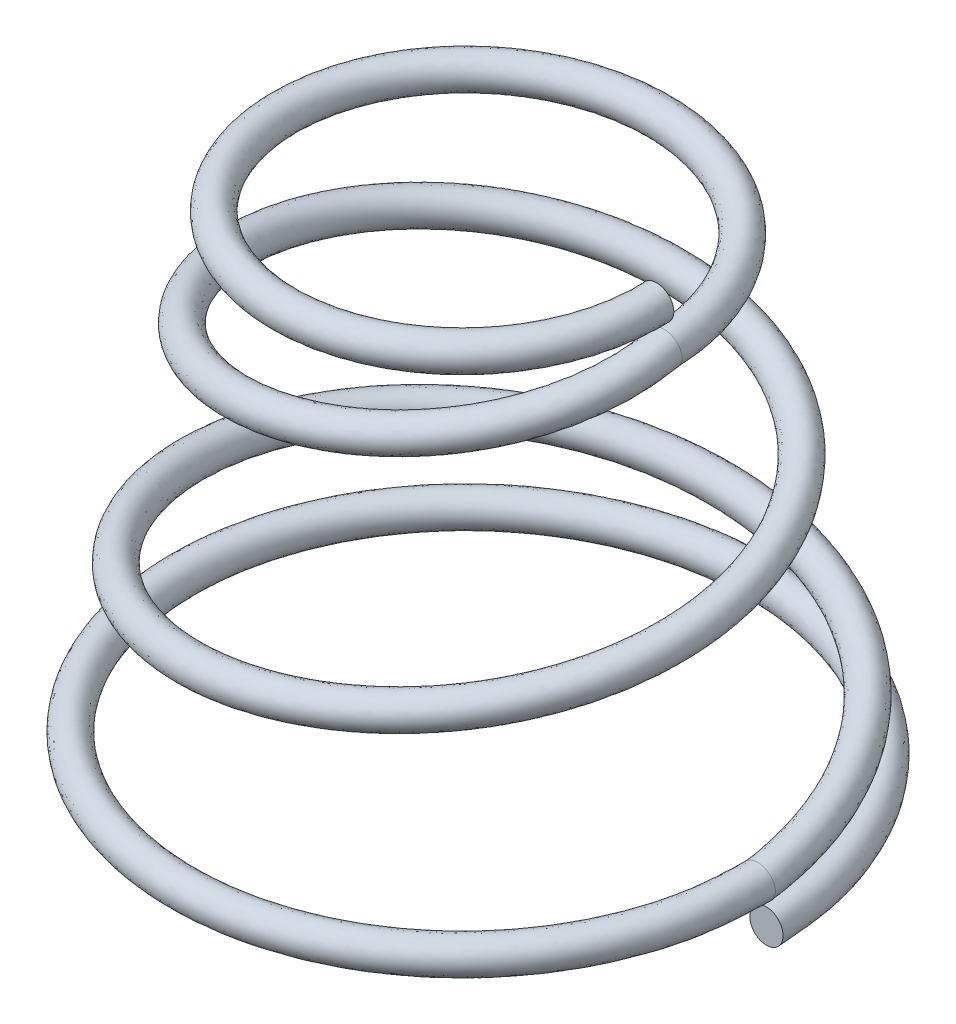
ISO-10303-21;
HEADER;
FILE_DESCRIPTION(('STEP AP214'),'2;1');
FILE_NAME('part.step','',(''),(''),'','','');
FILE_SCHEMA(('AUTOMOTIVE_DESIGN { 1 0 10303 214 1 1 1 1 }'));
ENDSEC;
DATA;
#1=APPLICATION_CONTEXT('core data for automotive mechanical design processes');
#2=APPLICATION_PROTOCOL_DEFINITION('international standard','automotive_design',2000,#1);
#3=PRODUCT_CONTEXT('',#1,'mechanical');
#4=PRODUCT('Part','Part','',(#3));
#5=PRODUCT_RELATED_PRODUCT_CATEGORY('part','',(#4));
#6=PRODUCT_DEFINITION_FORMATION('','',#4);
#7=PRODUCT_DEFINITION_CONTEXT('part definition',#1,'design');
#8=PRODUCT_DEFINITION('design','',#6,#7);
#9=PRODUCT_DEFINITION_SHAPE('','',#8);
#10=(LENGTH_UNIT() NAMED_UNIT(*) SI_UNIT(.MILLI.,.METRE.));
#11=(NAMED_UNIT(*) PLANE_ANGLE_UNIT() SI_UNIT($,.RADIAN.));
#12=(NAMED_UNIT(*) SI_UNIT($,.STERADIAN.) SOLID_ANGLE_UNIT());
#13=UNCERTAINTY_MEASURE_WITH_UNIT(LENGTH_MEASURE(1.E-05),#10,'distance_accuracy_value','');
#14=(GEOMETRIC_REPRESENTATION_CONTEXT(3) GLOBAL_UNCERTAINTY_ASSIGNED_CONTEXT((#13)) GLOBAL_UNIT_ASSIGNED_CONTEXT((#10,
#11,#12)) REPRESENTATION_CONTEXT('',''));
#15=CARTESIAN_POINT('',(0.,0.,0.));
#16=DIRECTION('',(0.,0.,1.));
#17=DIRECTION('',(1.,0.,0.));
#18=AXIS2_PLACEMENT_3D('',#15,#16,#17);
#19=CARTESIAN_POINT('',(7.52856,0.406399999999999,0.));
#20=CARTESIAN_POINT('',(7.49829714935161,0.415403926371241,-0.492363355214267));
#21=CARTESIAN_POINT('',(7.43779679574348,0.433404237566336,-1.47667766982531));
#22=CARTESIAN_POINT('',(6.98600493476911,0.460347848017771,-2.89488935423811));
#23=CARTESIAN_POINT('',(6.28522383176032,0.487384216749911,-4.19875211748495));
#24=CARTESIAN_POINT('',(5.3407368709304,0.514321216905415,-5.34066888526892));
#25=CARTESIAN_POINT('',(4.19240670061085,0.541359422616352,-6.27387032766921));
#26=CARTESIAN_POINT('',(2.88594503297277,0.568295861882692,-6.96675127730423));
#27=CARTESIAN_POINT('',(1.46992818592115,0.595334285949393,-7.3886532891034));
#28=CARTESIAN_POINT('',(0.000217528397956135,0.622270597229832,-7.52862581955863));
#29=CARTESIAN_POINT('',(-1.46710145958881,0.64930912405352,-7.37675391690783));
#30=CARTESIAN_POINT('',(-2.87620341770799,0.676245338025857,-6.94433295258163));
#31=CARTESIAN_POINT('',(-4.17159961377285,0.703283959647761,-6.24363318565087));
#32=CARTESIAN_POINT('',(-5.30610547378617,0.730220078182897,-5.30640633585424));
#33=CARTESIAN_POINT('',(-6.23323065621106,0.75725879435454,-4.16517058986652));
#34=CARTESIAN_POINT('',(-6.92158426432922,0.784194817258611,-2.86724104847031));
#35=CARTESIAN_POINT('',(-7.34071025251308,0.811233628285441,-1.46037452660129));
#36=CARTESIAN_POINT('',(-7.47973229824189,0.838169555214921,-0.000206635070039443));
#37=CARTESIAN_POINT('',(-7.3288061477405,0.865208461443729,1.45757683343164));
#38=CARTESIAN_POINT('',(-6.89915654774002,0.892144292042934,2.85750387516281));
#39=CARTESIAN_POINT('',(-6.20298024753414,0.919183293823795,4.14445093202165));
#40=CARTESIAN_POINT('',(-5.27182472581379,0.946119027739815,5.27154119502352));
#41=CARTESIAN_POINT('',(-4.13800147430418,0.97315812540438,6.19259134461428));
#42=CARTESIAN_POINT('',(-2.84851902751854,1.00009376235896,6.87641723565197));
#43=CARTESIAN_POINT('',(-1.45082516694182,1.02713295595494,7.29276730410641));
#44=CARTESIAN_POINT('',(-0.000195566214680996,1.05406849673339,7.43083863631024));
#45=CARTESIAN_POINT('',(1.44805680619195,1.08110778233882,7.28085885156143));
#46=CARTESIAN_POINT('',(2.83878677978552,1.10804324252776,6.8539781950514));
#47=CARTESIAN_POINT('',(4.11736872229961,1.13508256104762,6.1623342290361));
#48=CARTESIAN_POINT('',(5.2367297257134,1.16201816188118,5.23721684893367));
#49=CARTESIAN_POINT('',(6.1528739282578,1.18905668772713,4.11092966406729));
#50=CARTESIAN_POINT('',(6.82781451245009,1.21599550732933,2.82943363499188));
#51=CARTESIAN_POINT('',(7.2577224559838,1.24302757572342,1.44233131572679));
#52=CARTESIAN_POINT('',(7.30874214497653,1.26103108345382,0.476592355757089));
#53=CARTESIAN_POINT('',(7.33424925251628,1.27003187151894,-0.00622531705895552));
#54=CARTESIAN_POINT('',(7.52856,1.2192,0.));
#55=CARTESIAN_POINT('',(7.49827896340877,1.2282039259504,-0.49235439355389));
#56=CARTESIAN_POINT('',(7.43774225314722,1.24620423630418,-1.47665079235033));
#57=CARTESIAN_POINT('',(6.98604251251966,1.27314784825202,-2.89487703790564));
#58=CARTESIAN_POINT('',(6.28519178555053,1.30018421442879,-4.1986808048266));
#59=CARTESIAN_POINT('',(5.34079767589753,1.32712121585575,-5.34065398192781));
#60=CARTESIAN_POINT('',(4.19242655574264,1.3541594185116,-6.27377712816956));
#61=CARTESIAN_POINT('',(2.88603230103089,1.38109585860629,-6.96675089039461));
#62=CARTESIAN_POINT('',(1.47000887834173,1.40813427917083,-7.38856974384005));
#63=CARTESIAN_POINT('',(0.000325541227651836,1.43507059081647,-7.52865933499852));
#64=CARTESIAN_POINT('',(-1.46696824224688,1.46210911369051,-7.37671321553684));
#65=CARTESIAN_POINT('',(-2.87609139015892,1.489045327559,-6.94441614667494));
#66=CARTESIAN_POINT('',(-4.17143836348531,1.51608394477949,-6.24366201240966));
#67=CARTESIAN_POINT('',(-5.30601476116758,1.54302006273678,-5.30654579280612));
#68=CARTESIAN_POINT('',(-6.23307769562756,1.57005877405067,-4.16528193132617));
#69=CARTESIAN_POINT('',(-6.92154373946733,1.59699479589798,-2.86743020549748));
#70=CARTESIAN_POINT('',(-7.3406064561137,1.62403360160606,-1.46056301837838));
#71=CARTESIAN_POINT('',(-7.4797677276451,1.65096952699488,-0.00042450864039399));
#72=CARTESIAN_POINT('',(-7.32878807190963,1.67800842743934,1.4573359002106));
#73=CARTESIAN_POINT('',(-6.89928370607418,1.70494425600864,2.85729073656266));
#74=CARTESIAN_POINT('',(-6.20307141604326,1.73198325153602,4.14419850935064));
#75=CARTESIAN_POINT('',(-5.27204377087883,1.7589189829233,5.27137363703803));
#76=CARTESIAN_POINT('',(-4.13820562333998,1.78595807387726,6.19237777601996));
#77=CARTESIAN_POINT('',(-2.84881148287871,1.81289370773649,6.87633613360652));
#78=CARTESIAN_POINT('',(-1.45112296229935,1.8399328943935,7.29264259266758));
#79=CARTESIAN_POINT('',(-0.000524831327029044,1.86686843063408,7.43087749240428));
#80=CARTESIAN_POINT('',(1.44770666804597,1.89390771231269,7.280858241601));
#81=CARTESIAN_POINT('',(2.83847109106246,1.92084315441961,6.8541703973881));
#82=CARTESIAN_POINT('',(4.11702399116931,1.94788251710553,6.16241238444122));
#83=CARTESIAN_POINT('',(5.2364837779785,1.97481791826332,5.2378007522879));
#84=CARTESIAN_POINT('',(6.15260070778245,2.00185716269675,4.11016885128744));
#85=CARTESIAN_POINT('',(6.82768559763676,2.02879326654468,2.8337782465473));
#86=CARTESIAN_POINT('',(7.25760145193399,2.05583543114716,1.42802326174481));
#87=CARTESIAN_POINT('',(7.30866821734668,2.07381380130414,0.508727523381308));
#88=CARTESIAN_POINT('',(7.33419886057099,2.08280202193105,0.0491289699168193));
#89=CARTESIAN_POINT('',(6.71576,1.2192,0.));
#90=CARTESIAN_POINT('',(6.68850129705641,1.2281845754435,-0.439165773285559));
#91=CARTESIAN_POINT('',(6.63400672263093,1.24614620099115,-1.31712948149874));
#92=CARTESIAN_POINT('',(6.23062366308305,1.27317949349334,-2.58188264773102));
#93=CARTESIAN_POINT('',(5.60488323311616,1.30011812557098,-3.74425224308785));
#94=CARTESIAN_POINT('',(4.7623433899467,1.32715556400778,-4.76225222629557));
#95=CARTESIAN_POINT('',(3.73789637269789,1.35409301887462,-5.59363178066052));
#96=CARTESIAN_POINT('',(2.5729376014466,1.38113084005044,-6.21099999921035));
#97=CARTESIAN_POINT('',(1.31037012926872,1.40806812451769,-6.5862577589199));
#98=CARTESIAN_POINT('',(0.000281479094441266,1.43510605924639,-6.71061967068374));
#99=CARTESIAN_POINT('',(-1.30741736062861,1.46204324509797,-6.57438385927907));
#100=CARTESIAN_POINT('',(-2.56307640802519,1.48908127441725,-6.18863144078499));
#101=CARTESIAN_POINT('',(-3.71698935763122,1.51601836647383,-5.56346719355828));
#102=CARTESIAN_POINT('',(-4.7275960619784,1.54305648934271,-4.72808170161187));
#103=CARTESIAN_POINT('',(-5.5529188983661,1.5699934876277,-3.71077901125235));
#104=CARTESIAN_POINT('',(-6.16578359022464,1.59703170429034,-2.55435594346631));
#105=CARTESIAN_POINT('',(-6.53828973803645,1.62396860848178,-1.30094854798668));
#106=CARTESIAN_POINT('',(-6.6617280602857,1.65100691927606,-0.00040459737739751));
#107=CARTESIAN_POINT('',(-6.52646345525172,1.67794372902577,1.297761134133));
#108=CARTESIAN_POINT('',(-6.14350832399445,1.70498213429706,2.54425324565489));
#109=CARTESIAN_POINT('',(-5.52289014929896,1.73191884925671,3.68972921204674));
#110=CARTESIAN_POINT('',(-4.69359697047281,1.75895734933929,4.69293764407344));
#111=CARTESIAN_POINT('',(-3.68372306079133,1.78589396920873,5.51220536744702));
#112=CARTESIAN_POINT('',(-2.53575988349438,1.81293256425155,6.12056661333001));
#113=CARTESIAN_POINT('',(-1.29153262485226,1.83986908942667,6.49032099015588));
#114=CARTESIAN_POINT('',(-0.000529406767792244,1.86690777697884,6.6128381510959));
#115=CARTESIAN_POINT('',(1.2881071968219,1.89384421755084,6.47853720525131));
#116=CARTESIAN_POINT('',(2.52541272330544,1.92088295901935,6.09840904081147));
#117=CARTESIAN_POINT('',(3.66252683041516,1.94781945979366,5.48222782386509));
#118=CARTESIAN_POINT('',(4.65805742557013,1.97485771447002,4.65943498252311));
#119=CARTESIAN_POINT('',(5.47231320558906,2.00179629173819,3.65547026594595));
#120=CARTESIAN_POINT('',(6.07228411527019,2.02882654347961,2.52163173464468));
#121=CARTESIAN_POINT('',(6.45385735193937,2.05580100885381,1.26520171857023));
#122=CARTESIAN_POINT('',(6.49888763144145,2.07375983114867,0.462758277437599));
#123=CARTESIAN_POINT('',(6.52140035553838,2.08273827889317,0.0615796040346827));
#124=CARTESIAN_POINT('',(6.71576,0.406399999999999,0.));
#125=CARTESIAN_POINT('',(6.68851948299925,0.415384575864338,-0.439174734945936));
#126=CARTESIAN_POINT('',(6.6340612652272,0.433346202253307,-1.31715635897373));
#127=CARTESIAN_POINT('',(6.2305860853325,0.46037949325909,-2.58189496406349));
#128=CARTESIAN_POINT('',(5.60491527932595,0.487318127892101,-3.74432355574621));
#129=CARTESIAN_POINT('',(4.76228258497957,0.514355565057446,-4.76226712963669));
#130=CARTESIAN_POINT('',(3.73787651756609,0.541293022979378,-5.59372498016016));
#131=CARTESIAN_POINT('',(2.57285033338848,0.568330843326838,-6.21100038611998));
#132=CARTESIAN_POINT('',(1.31028943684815,0.595268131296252,-6.58634130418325));
#133=CARTESIAN_POINT('',(0.000173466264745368,0.622306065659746,-6.71058615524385));
#134=CARTESIAN_POINT('',(-1.30755057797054,0.64924325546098,-6.57442456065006));
#135=CARTESIAN_POINT('',(-2.56318843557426,0.676281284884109,-6.18854824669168));
#136=CARTESIAN_POINT('',(-3.71715060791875,0.703218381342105,-5.56343836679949));
#137=CARTESIAN_POINT('',(-4.72768677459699,0.730256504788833,-4.72794224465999));
#138=CARTESIAN_POINT('',(-5.5530718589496,0.757193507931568,-3.7106676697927));
#139=CARTESIAN_POINT('',(-6.16582411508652,0.784231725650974,-2.55416678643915));
#140=CARTESIAN_POINT('',(-6.53839353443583,0.811168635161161,-1.30076005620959));
#141=CARTESIAN_POINT('',(-6.6616926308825,0.838206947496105,-0.000186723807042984));
#142=CARTESIAN_POINT('',(-6.52648153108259,0.865143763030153,1.29800206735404));
#143=CARTESIAN_POINT('',(-6.14338116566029,0.892182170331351,2.54446638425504));
#144=CARTESIAN_POINT('',(-5.52279898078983,0.919118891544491,3.68998163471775));
#145=CARTESIAN_POINT('',(-4.69337792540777,0.946157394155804,4.69310520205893));
#146=CARTESIAN_POINT('',(-3.68351891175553,0.973094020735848,5.51241893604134));
#147=CARTESIAN_POINT('',(-2.53546742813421,1.00013261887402,6.12064771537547));
#148=CARTESIAN_POINT('',(-1.29123482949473,1.0270691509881,6.49044570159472));
#149=CARTESIAN_POINT('',(-0.00020014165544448,1.05410784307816,6.61279929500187));
#150=CARTESIAN_POINT('',(1.28845733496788,1.08104428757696,6.47853781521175));
#151=CARTESIAN_POINT('',(2.5257284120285,1.10808304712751,6.09821683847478));
#152=CARTESIAN_POINT('',(3.66287156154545,1.13501950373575,5.48214966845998));
#153=CARTESIAN_POINT('',(4.65830337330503,1.16205795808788,4.65885107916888));
#154=CARTESIAN_POINT('',(5.4725864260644,1.18899581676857,3.65623107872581));
#155=CARTESIAN_POINT('',(6.07241303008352,1.21602878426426,2.51728712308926));
#156=CARTESIAN_POINT('',(6.45397835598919,1.24299315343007,1.27950977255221));
#157=CARTESIAN_POINT('',(6.4989615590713,1.26097711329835,0.43062310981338));
#158=CARTESIAN_POINT('',(6.52145074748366,1.26996812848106,0.00622531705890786));
#159=CARTESIAN_POINT('',(6.71576,-0.4064,0.));
#160=CARTESIAN_POINT('',(6.6885376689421,-0.397415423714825,-0.439183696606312));
#161=CARTESIAN_POINT('',(6.63411580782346,-0.379453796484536,-1.31718323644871));
#162=CARTESIAN_POINT('',(6.23054850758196,-0.352420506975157,-2.58190728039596));
#163=CARTESIAN_POINT('',(5.60494732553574,-0.325481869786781,-3.74439486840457));
#164=CARTESIAN_POINT('',(4.76222178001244,-0.298444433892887,-4.76228203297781));
#165=CARTESIAN_POINT('',(3.7378566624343,-0.271506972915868,-5.5938181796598));
#166=CARTESIAN_POINT('',(2.57276306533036,-0.244469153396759,-6.2110007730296));
#167=CARTESIAN_POINT('',(1.31020874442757,-0.217531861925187,-6.58642484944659));
#168=CARTESIAN_POINT('',(6.5453435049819E-05,-0.190493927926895,-6.71055263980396));
#169=CARTESIAN_POINT('',(-1.30768379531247,-0.16355673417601,-6.57446526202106));
#170=CARTESIAN_POINT('',(-2.56330046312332,-0.13651870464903,-6.18846505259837));
#171=CARTESIAN_POINT('',(-3.71731185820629,-0.109581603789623,-5.5634095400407));
#172=CARTESIAN_POINT('',(-4.72777748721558,-0.0825434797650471,-4.72780278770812));
#173=CARTESIAN_POINT('',(-5.55322481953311,-0.0556064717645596,-3.71055632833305));
#174=CARTESIAN_POINT('',(-6.16586463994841,-0.0285682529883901,-2.55397762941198));
#175=CARTESIAN_POINT('',(-6.53849733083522,-0.00163133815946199,-1.30057156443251));
#176=CARTESIAN_POINT('',(-6.6616572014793,0.025406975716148,3.11497633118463E-05));
#177=CARTESIAN_POINT('',(-6.52649960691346,0.0523437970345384,1.29824300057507));
#178=CARTESIAN_POINT('',(-6.14325400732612,0.0793822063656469,2.54467952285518));
#179=CARTESIAN_POINT('',(-5.52270781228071,0.106318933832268,3.69023405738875));
#180=CARTESIAN_POINT('',(-4.69315888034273,0.133357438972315,4.69327276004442));
#181=CARTESIAN_POINT('',(-3.68331476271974,0.160294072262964,5.51263250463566));
#182=CARTESIAN_POINT('',(-2.53517497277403,0.187332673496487,6.12072881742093));
#183=CARTESIAN_POINT('',(-1.2909370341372,0.214269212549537,6.49057041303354));
#184=CARTESIAN_POINT('',(0.000129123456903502,0.241307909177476,6.61276043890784));
#185=CARTESIAN_POINT('',(1.28880747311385,0.268244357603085,6.47853842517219));
#186=CARTESIAN_POINT('',(2.52604410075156,0.29528313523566,6.09802463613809));
#187=CARTESIAN_POINT('',(3.66321629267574,0.322219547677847,5.48207151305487));
#188=CARTESIAN_POINT('',(4.65854932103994,0.349258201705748,4.65826717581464));
#189=CARTESIAN_POINT('',(5.47285964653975,0.376195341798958,3.65699189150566));
#190=CARTESIAN_POINT('',(6.07254194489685,0.403231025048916,2.51294251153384));
#191=CARTESIAN_POINT('',(6.45409936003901,0.430185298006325,1.29381782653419));
#192=CARTESIAN_POINT('',(6.49903548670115,0.448194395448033,0.398487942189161));
#193=CARTESIAN_POINT('',(6.52150113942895,0.457197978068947,-0.049128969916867));
#194=CARTESIAN_POINT('',(7.52856,-0.4064,0.));
#195=CARTESIAN_POINT('',(7.49831533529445,-0.397396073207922,-0.492372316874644));
#196=CARTESIAN_POINT('',(7.43785133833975,-0.379395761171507,-1.47670454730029));
#197=CARTESIAN_POINT('',(6.98596735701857,-0.352452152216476,-2.89490167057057));
#198=CARTESIAN_POINT('',(6.28525587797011,-0.325415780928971,-4.19882343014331));
#199=CARTESIAN_POINT('',(5.34067606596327,-0.298478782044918,-5.34068378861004));
#200=CARTESIAN_POINT('',(4.19238684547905,-0.271440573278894,-6.27396352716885));
#201=CARTESIAN_POINT('',(2.88585776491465,-0.244504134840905,-6.96675166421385));
#202=CARTESIAN_POINT('',(1.46984749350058,-0.217465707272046,-7.38873683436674));
#203=CARTESIAN_POINT('',(0.00010951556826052,-0.190529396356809,-7.52859230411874));
#204=CARTESIAN_POINT('',(-1.46723467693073,-0.16349086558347,-7.37679461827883));
#205=CARTESIAN_POINT('',(-2.87631544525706,-0.136554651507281,-6.94424975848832));
#206=CARTESIAN_POINT('',(-4.17176086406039,-0.109516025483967,-6.24360435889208));
#207=CARTESIAN_POINT('',(-5.30619618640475,-0.0825799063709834,-5.30626687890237));
#208=CARTESIAN_POINT('',(-6.23338361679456,-0.0555411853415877,-4.16505924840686));
#209=CARTESIAN_POINT('',(-6.9216247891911,-0.0286051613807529,-2.86705189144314));
#210=CARTESIAN_POINT('',(-7.34081404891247,-0.0015663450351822,-1.46018603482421));
#211=CARTESIAN_POINT('',(-7.47969686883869,0.0253695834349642,1.12385003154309E-05));
#212=CARTESIAN_POINT('',(-7.32882422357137,0.0524084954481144,1.45781776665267));
#213=CARTESIAN_POINT('',(-6.89902938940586,0.0793443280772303,2.85771701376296));
#214=CARTESIAN_POINT('',(-6.20288907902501,0.106383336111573,4.14470335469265));
#215=CARTESIAN_POINT('',(-5.27160568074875,0.133319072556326,5.271708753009));
#216=CARTESIAN_POINT('',(-4.13779732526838,0.160358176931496,6.19280491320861));
#217=CARTESIAN_POINT('',(-2.84822657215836,0.187293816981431,6.87649833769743));
#218=CARTESIAN_POINT('',(-1.45052737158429,0.214333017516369,7.29289201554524));
#219=CARTESIAN_POINT('',(0.000133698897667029,0.24126856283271,7.43079978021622));
#220=CARTESIAN_POINT('',(1.44840694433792,0.268307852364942,7.28085946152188));
#221=CARTESIAN_POINT('',(2.83910246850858,0.295243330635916,6.85378599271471));
#222=CARTESIAN_POINT('',(4.1177134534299,0.322282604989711,6.16225607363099));
#223=CARTESIAN_POINT('',(5.23697567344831,0.349218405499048,5.23663294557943));
#224=CARTESIAN_POINT('',(6.15314714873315,0.376256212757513,4.11169047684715));
#225=CARTESIAN_POINT('',(6.82794342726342,0.403197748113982,2.82508902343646));
#226=CARTESIAN_POINT('',(7.25784346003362,0.430219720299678,1.45663936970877));
#227=CARTESIAN_POINT('',(7.30881607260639,0.4482483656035,0.44445718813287));
#228=CARTESIAN_POINT('',(7.33429964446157,0.457261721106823,-0.0615796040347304));
#229=CARTESIAN_POINT('',(7.52856,0.406399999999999,0.));
#230=CARTESIAN_POINT('',(7.49829714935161,0.415403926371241,-0.492363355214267));
#231=CARTESIAN_POINT('',(7.43779679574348,0.433404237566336,-1.47667766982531));
#232=CARTESIAN_POINT('',(6.98600493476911,0.460347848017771,-2.89488935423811));
#233=CARTESIAN_POINT('',(6.28522383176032,0.487384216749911,-4.19875211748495));
#234=CARTESIAN_POINT('',(5.3407368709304,0.514321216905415,-5.34066888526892));
#235=CARTESIAN_POINT('',(4.19240670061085,0.541359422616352,-6.27387032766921));
#236=CARTESIAN_POINT('',(2.88594503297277,0.568295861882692,-6.96675127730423));
#237=CARTESIAN_POINT('',(1.46992818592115,0.595334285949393,-7.3886532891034));
#238=CARTESIAN_POINT('',(0.000217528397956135,0.622270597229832,-7.52862581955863));
#239=CARTESIAN_POINT('',(-1.46710145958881,0.64930912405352,-7.37675391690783));
#240=CARTESIAN_POINT('',(-2.87620341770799,0.676245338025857,-6.94433295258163));
#241=CARTESIAN_POINT('',(-4.17159961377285,0.703283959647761,-6.24363318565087));
#242=CARTESIAN_POINT('',(-5.30610547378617,0.730220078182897,-5.30640633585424));
#243=CARTESIAN_POINT('',(-6.23323065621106,0.75725879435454,-4.16517058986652));
#244=CARTESIAN_POINT('',(-6.92158426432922,0.784194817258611,-2.86724104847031));
#245=CARTESIAN_POINT('',(-7.34071025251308,0.811233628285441,-1.46037452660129));
#246=CARTESIAN_POINT('',(-7.47973229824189,0.838169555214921,-0.000206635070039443));
#247=CARTESIAN_POINT('',(-7.3288061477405,0.865208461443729,1.45757683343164));
#248=CARTESIAN_POINT('',(-6.89915654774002,0.892144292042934,2.85750387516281));
#249=CARTESIAN_POINT('',(-6.20298024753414,0.919183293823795,4.14445093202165));
#250=CARTESIAN_POINT('',(-5.27182472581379,0.946119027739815,5.27154119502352));
#251=CARTESIAN_POINT('',(-4.13800147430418,0.97315812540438,6.19259134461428));
#252=CARTESIAN_POINT('',(-2.84851902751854,1.00009376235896,6.87641723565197));
#253=CARTESIAN_POINT('',(-1.45082516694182,1.02713295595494,7.29276730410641));
#254=CARTESIAN_POINT('',(-0.000195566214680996,1.05406849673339,7.43083863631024));
#255=CARTESIAN_POINT('',(1.44805680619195,1.08110778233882,7.28085885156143));
#256=CARTESIAN_POINT('',(2.83878677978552,1.10804324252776,6.8539781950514));
#257=CARTESIAN_POINT('',(4.11736872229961,1.13508256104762,6.1623342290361));
#258=CARTESIAN_POINT('',(5.2367297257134,1.16201816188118,5.23721684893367));
#259=CARTESIAN_POINT('',(6.1528739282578,1.18905668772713,4.11092966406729));
#260=CARTESIAN_POINT('',(6.82781451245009,1.21599550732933,2.82943363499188));
#261=CARTESIAN_POINT('',(7.2577224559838,1.24302757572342,1.44233131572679));
#262=CARTESIAN_POINT('',(7.30874214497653,1.26103108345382,0.476592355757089));
#263=CARTESIAN_POINT('',(7.33424925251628,1.27003187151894,-0.00622531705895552));
#264=(BOUNDED_SURFACE() B_SPLINE_SURFACE(3,3,((#19,#20,#21,#22,#23,#24,#25,#26,#27,#28,#29,#30,
#31,#32,#33,#34,#35,#36,#37,#38,#39,#40,#41,#42,#43,#44,#45,#46,#47,#48,#49,#50,#51,#52,#53),
(#54,#55,#56,#57,#58,#59,#60,#61,#62,#63,#64,#65,#66,#67,#68,#69,#70,#71,#72,#73,#74,#75,#76,
#77,#78,#79,#80,#81,#82,#83,#84,#85,#86,#87,#88),(#89,#90,#91,#92,#93,#94,#95,#96,#97,#98,#99,
#100,#101,#102,#103,#104,#105,#106,#107,#108,#109,#110,#111,#112,#113,#114,#115,#116,#117,#118,
#119,#120,#121,#122,#123),(#124,#125,#126,#127,#128,#129,#130,#131,#132,#133,#134,#135,#136,
#137,#138,#139,#140,#141,#142,#143,#144,#145,#146,#147,#148,#149,#150,#151,#152,#153,#154,#155,
#156,#157,#158),(#159,#160,#161,#162,#163,#164,#165,#166,#167,#168,#169,#170,#171,#172,#173,
#174,#175,#176,#177,#178,#179,#180,#181,#182,#183,#184,#185,#186,#187,#188,#189,#190,#191,#192,
#193),(#194,#195,#196,#197,#198,#199,#200,#201,#202,#203,#204,#205,#206,#207,#208,#209,#210,
#211,#212,#213,#214,#215,#216,#217,#218,#219,#220,#221,#222,#223,#224,#225,#226,#227,#228),
(#229,#230,#231,#232,#233,#234,#235,#236,#237,#238,#239,#240,#241,#242,#243,#244,#245,#246,#247,
#248,#249,#250,#251,#252,#253,#254,#255,#256,#257,#258,#259,#260,#261,#262,#263)),.UNSPECIFIED.,
.T.,.F.,.F.) B_SPLINE_SURFACE_WITH_KNOTS((4,3,4),(4,1,1,1,1,1,1,1,1,1,1,1,1,1,1,1,1,1,1,1,1,1,1,
1,1,1,1,1,1,1,1,1,4),(0.,0.5,1.),(0.,0.0316643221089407,0.0633021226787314,0.0949128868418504,
0.126497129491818,0.15805433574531,0.189585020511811,0.221088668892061,0.25256579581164,
0.284015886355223,0.31543945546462,0.346835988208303,0.378205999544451,0.409548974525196,
0.440865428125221,0.472154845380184,0.50341774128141,0.534653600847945,0.565862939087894,
0.597045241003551,0.628201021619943,0.659329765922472,0.69043198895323,0.721507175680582,
0.752555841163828,0.783577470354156,0.814572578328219,0.845540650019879,0.87648220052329,
0.907396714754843,0.938284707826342,0.969145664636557,1.),
.UNSPECIFIED.) GEOMETRIC_REPRESENTATION_ITEM() RATIONAL_B_SPLINE_SURFACE(((1.,1.,1.,1.,1.,1.,1.,
1.,1.,1.,1.,1.,1.,1.,1.,1.,1.,1.,1.,1.,1.,1.,1.,1.,1.,1.,1.,1.,1.,1.,1.,1.,1.,1.,1.),
(0.333333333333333,0.333333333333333,0.333333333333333,0.333333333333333,0.333333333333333,
0.333333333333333,0.333333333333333,0.333333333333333,0.333333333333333,0.333333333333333,
0.333333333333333,0.333333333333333,0.333333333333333,0.333333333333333,0.333333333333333,
0.333333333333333,0.333333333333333,0.333333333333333,0.333333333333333,0.333333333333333,
0.333333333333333,0.333333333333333,0.333333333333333,0.333333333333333,0.333333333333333,
0.333333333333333,0.333333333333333,0.333333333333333,0.333333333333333,0.333333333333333,
0.333333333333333,0.333333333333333,0.333333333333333,0.333333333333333,0.333333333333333),
(0.333333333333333,0.333333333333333,0.333333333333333,0.333333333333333,0.333333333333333,
0.333333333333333,0.333333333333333,0.333333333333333,0.333333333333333,0.333333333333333,
0.333333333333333,0.333333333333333,0.333333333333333,0.333333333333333,0.333333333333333,
0.333333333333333,0.333333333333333,0.333333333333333,0.333333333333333,0.333333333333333,
0.333333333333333,0.333333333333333,0.333333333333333,0.333333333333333,0.333333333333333,
0.333333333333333,0.333333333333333,0.333333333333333,0.333333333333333,0.333333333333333,
0.333333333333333,0.333333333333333,0.333333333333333,0.333333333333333,0.333333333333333),(1.,
1.,1.,1.,1.,1.,1.,1.,1.,1.,1.,1.,1.,1.,1.,1.,1.,1.,1.,1.,1.,1.,1.,1.,1.,1.,1.,1.,1.,1.,1.,1.,1.,
1.,1.),(0.333333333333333,0.333333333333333,0.333333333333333,0.333333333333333,
0.333333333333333,0.333333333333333,0.333333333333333,0.333333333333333,0.333333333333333,
0.333333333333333,0.333333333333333,0.333333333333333,0.333333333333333,0.333333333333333,
0.333333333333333,0.333333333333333,0.333333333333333,0.333333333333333,0.333333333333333,
0.333333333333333,0.333333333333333,0.333333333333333,0.333333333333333,0.333333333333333,
0.333333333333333,0.333333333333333,0.333333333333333,0.333333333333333,0.333333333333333,
0.333333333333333,0.333333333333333,0.333333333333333,0.333333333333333,0.333333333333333,
0.333333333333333),(0.333333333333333,0.333333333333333,0.333333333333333,0.333333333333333,
0.333333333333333,0.333333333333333,0.333333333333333,0.333333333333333,0.333333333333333,
0.333333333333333,0.333333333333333,0.333333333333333,0.333333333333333,0.333333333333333,
0.333333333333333,0.333333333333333,0.333333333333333,0.333333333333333,0.333333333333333,
0.333333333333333,0.333333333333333,0.333333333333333,0.333333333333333,0.333333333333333,
0.333333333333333,0.333333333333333,0.333333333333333,0.333333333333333,0.333333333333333,
0.333333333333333,0.333333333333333,0.333333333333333,0.333333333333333,0.333333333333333,
0.333333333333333),(1.,1.,1.,1.,1.,1.,1.,1.,1.,1.,1.,1.,1.,1.,1.,1.,1.,1.,1.,1.,1.,1.,1.,1.,1.,
1.,1.,1.,1.,1.,1.,1.,1.,1.,1.))) REPRESENTATION_ITEM('') SURFACE());
#265=CARTESIAN_POINT('',(7.12216,0.406399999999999,0.));
#266=DIRECTION('',(0.,0.,1.));
#267=DIRECTION('',(1.,0.,0.));
#268=AXIS2_PLACEMENT_3D('',#265,#266,#267);
#269=CIRCLE('',#268,0.4064);
#270=CARTESIAN_POINT('',(7.52856,0.406399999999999,0.));
#271=VERTEX_POINT('',#270);
#272=EDGE_CURVE('E11',#271,#271,#269,.T.);
#273=CARTESIAN_POINT('',(7.33424925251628,1.27003187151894,-0.00622531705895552));
#274=CARTESIAN_POINT('',(7.33419886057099,2.08280202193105,0.0491289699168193));
#275=CARTESIAN_POINT('',(6.52140035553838,2.08273827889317,0.0615796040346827));
#276=CARTESIAN_POINT('',(6.52145074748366,1.26996812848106,0.00622531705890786));
#277=CARTESIAN_POINT('',(6.52150113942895,0.457197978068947,-0.049128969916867));
#278=CARTESIAN_POINT('',(7.33429964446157,0.457261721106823,-0.0615796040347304));
#279=CARTESIAN_POINT('',(7.33424925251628,1.27003187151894,-0.00622531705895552));
#280=(BOUNDED_CURVE() B_SPLINE_CURVE(3,(#273,#274,#275,#276,#277,#278,#279),.UNSPECIFIED.,.T.,
.F.) B_SPLINE_CURVE_WITH_KNOTS((4,3,4),(0.,0.5,1.),
.UNSPECIFIED.) CURVE() GEOMETRIC_REPRESENTATION_ITEM() RATIONAL_B_SPLINE_CURVE((1.,
0.333333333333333,0.333333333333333,1.,0.333333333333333,0.333333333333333,1.)) REPRESENTATION_ITEM(''));
#281=CARTESIAN_POINT('',(7.33424925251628,1.27003187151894,-0.00622531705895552));
#282=VERTEX_POINT('',#281);
#283=EDGE_CURVE('E65',#282,#282,#280,.F.);
#284=ORIENTED_EDGE('',*,*,#272,.F.);
#285=EDGE_LOOP('',(#284));
#286=FACE_BOUND('',#285,.T.);
#287=ORIENTED_EDGE('',*,*,#283,.F.);
#288=EDGE_LOOP('',(#287));
#289=FACE_BOUND('',#288,.T.);
#290=ADVANCED_FACE('F57',(#286,#289),#264,.F.);
#291=CARTESIAN_POINT('',(7.12216,0.406399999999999,0.));
#292=DIRECTION('',(0.,0.,1.));
#293=DIRECTION('',(1.,0.,0.));
#294=AXIS2_PLACEMENT_3D('',#291,#292,#293);
#295=PLANE('',#294);
#296=ORIENTED_EDGE('',*,*,#272,.T.);
#297=EDGE_LOOP('',(#296));
#298=FACE_BOUND('',#297,.T.);
#299=ADVANCED_FACE('F108',(#298),#295,.T.);
#300=CARTESIAN_POINT('',(7.33424925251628,1.27003187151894,-0.00622531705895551));
#301=CARTESIAN_POINT('',(7.3223924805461,1.32272863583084,-0.457767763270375));
#302=CARTESIAN_POINT('',(7.20147350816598,1.42939354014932,-1.45626345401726));
#303=CARTESIAN_POINT('',(6.75004467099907,1.58739685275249,-2.80236211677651));
#304=CARTESIAN_POINT('',(6.04184065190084,1.74665447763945,-4.04946952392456));
#305=CARTESIAN_POINT('',(5.11133948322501,1.90492511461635,-5.12464117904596));
#306=CARTESIAN_POINT('',(3.99264103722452,2.06410940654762,-5.99276558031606));
#307=CARTESIAN_POINT('',(2.73341095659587,2.22239442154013,-6.62441883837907));
#308=CARTESIAN_POINT('',(1.38127382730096,2.38157888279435,-6.99396370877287));
#309=CARTESIAN_POINT('',(-0.00984225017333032,2.53985858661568,-7.09430781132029));
#310=CARTESIAN_POINT('',(-1.3864358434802,2.69904855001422,-6.91963237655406));
#311=CARTESIAN_POINT('',(-2.69656594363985,2.85732137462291,-6.4840417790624));
#312=CARTESIAN_POINT('',(-3.88909132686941,3.0165173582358,-5.80249538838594));
#313=CARTESIAN_POINT('',(-4.92188327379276,3.17478300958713,-4.90760825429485));
#314=CARTESIAN_POINT('',(-5.75386606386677,3.33398519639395,-3.83246877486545));
#315=CARTESIAN_POINT('',(-6.3589061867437,3.49224346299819,-2.62287858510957));
#316=CARTESIAN_POINT('',(-6.71201660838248,3.65145201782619,-1.32467656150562));
#317=CARTESIAN_POINT('',(-6.80669068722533,3.80970268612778,0.0103575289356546));
#318=CARTESIAN_POINT('',(-6.63749000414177,3.96891777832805,1.33084195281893));
#319=CARTESIAN_POINT('',(-6.2181148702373,4.12716062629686,2.58698618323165));
#320=CARTESIAN_POINT('',(-5.56309787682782,4.28638243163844,3.72976813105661));
#321=CARTESIAN_POINT('',(-4.70384893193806,4.44461722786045,4.71888749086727));
#322=CARTESIAN_POINT('',(-3.67225393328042,4.60384592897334,5.51506385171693));
#323=CARTESIAN_POINT('',(-2.51230044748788,4.76207243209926,6.09339178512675));
#324=CARTESIAN_POINT('',(-1.26803005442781,4.92130821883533,6.43008269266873));
#325=CARTESIAN_POINT('',(0.0109239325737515,5.07952617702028,6.51907047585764));
#326=CARTESIAN_POINT('',(1.27529830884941,5.23876924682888,6.35533624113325));
#327=CARTESIAN_POINT('',(2.47745472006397,5.39697839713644,5.95216587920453));
#328=CARTESIAN_POINT('',(3.57048838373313,5.55622895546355,5.32366917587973));
#329=CARTESIAN_POINT('',(4.51592924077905,5.71442902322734,4.50004934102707));
#330=CARTESIAN_POINT('',(5.27629086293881,5.87368728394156,3.51199191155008));
#331=CARTESIAN_POINT('',(5.82789734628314,6.03187798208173,2.40166879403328));
#332=CARTESIAN_POINT('',(6.14815802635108,6.19114416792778,1.21132669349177));
#333=CARTESIAN_POINT('',(6.23144811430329,6.34932519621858,-0.0115495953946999));
#334=CARTESIAN_POINT('',(6.07316872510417,6.5085995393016,-1.21981287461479));
#335=CARTESIAN_POINT('',(5.68619123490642,6.6667705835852,-2.36797925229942));
#336=CARTESIAN_POINT('',(5.08420410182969,6.82605332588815,-3.41125901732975));
#337=CARTESIAN_POINT('',(4.29620282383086,6.98421405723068,-4.3130145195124));
#338=CARTESIAN_POINT('',(3.35167489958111,7.14350545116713,-5.03755175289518));
#339=CARTESIAN_POINT('',(2.29097472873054,7.30165552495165,-5.56242600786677));
#340=CARTESIAN_POINT('',(1.15455700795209,7.46095583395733,-5.86624398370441));
#341=CARTESIAN_POINT('',(-0.0122444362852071,7.61909488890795,-5.9438230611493));
#342=CARTESIAN_POINT('',(-1.16439541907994,7.77840438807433,-5.79098496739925));
#343=CARTESIAN_POINT('',(-2.25856921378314,7.93653204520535,-5.42018640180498));
#344=CARTESIAN_POINT('',(-3.2520885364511,8.0958510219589,-4.84469628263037));
#345=CARTESIAN_POINT('',(-4.11015067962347,8.25396688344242,-4.09230114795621));
#346=CARTESIAN_POINT('',(-4.79885222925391,8.41329563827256,-3.19129324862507));
#347=CARTESIAN_POINT('',(-5.29698160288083,8.57139928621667,-2.18020725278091));
#348=CARTESIAN_POINT('',(-5.58434222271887,8.73073813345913,-1.09770927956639));
#349=CARTESIAN_POINT('',(-5.65619459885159,8.88882912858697,0.0130207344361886));
#350=CARTESIAN_POINT('',(-5.50878183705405,9.048178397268,1.10905804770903));
#351=CARTESIAN_POINT('',(-5.15414570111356,9.20625627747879,2.14923629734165));
#352=CARTESIAN_POINT('',(-4.60513775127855,9.36561631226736,3.09298749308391));
#353=CARTESIAN_POINT('',(-3.88833402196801,9.52368059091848,3.90734683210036));
#354=CARTESIAN_POINT('',(-3.03083488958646,9.68305175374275,4.56019938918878));
#355=CARTESIAN_POINT('',(-2.06935260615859,9.84110191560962,5.03156878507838));
#356=CARTESIAN_POINT('',(-1.04076881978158,10.0004845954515,5.30245504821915));
#357=CARTESIAN_POINT('',(0.0138938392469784,10.1585200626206,5.3685606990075));
#358=CARTESIAN_POINT('',(1.05381608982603,10.3179147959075,5.22655926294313));
#359=CARTESIAN_POINT('',(2.03999465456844,10.4759344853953,4.8880474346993));
#360=CARTESIAN_POINT('',(2.93397106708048,10.6353435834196,4.365571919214));
#361=CARTESIAN_POINT('',(3.7046073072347,10.7933399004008,3.6840908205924));
#362=CARTESIAN_POINT('',(4.32162837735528,10.9527896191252,2.87101399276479));
#363=CARTESIAN_POINT('',(4.76609649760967,11.1106666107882,1.95570004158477));
#364=CARTESIAN_POINT('',(5.02084864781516,11.2704501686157,0.994014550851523));
#365=CARTESIAN_POINT('',(5.0601470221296,11.3750822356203,0.295042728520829));
#366=CARTESIAN_POINT('',(5.04821369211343,11.4281192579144,-0.00945663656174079));
#367=CARTESIAN_POINT('',(7.33429964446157,0.457261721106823,-0.0615796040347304));
#368=CARTESIAN_POINT('',(7.32462183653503,0.500274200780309,-0.430140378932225));
#369=CARTESIAN_POINT('',(7.17815046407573,0.627801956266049,-1.60610094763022));
#370=CARTESIAN_POINT('',(6.71332477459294,0.77753565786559,-2.87546749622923));
#371=CARTESIAN_POINT('',(5.98757100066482,0.939066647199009,-4.13332430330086));
#372=CARTESIAN_POINT('',(5.04194494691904,1.09680566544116,-5.19109077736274));
#373=CARTESIAN_POINT('',(3.91130663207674,1.25620834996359,-6.04666059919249));
#374=CARTESIAN_POINT('',(2.64241490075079,1.41451055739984,-6.66040726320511));
#375=CARTESIAN_POINT('',(1.28460705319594,1.57376987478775,-7.01249534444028));
#376=CARTESIAN_POINT('',(-0.108751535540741,1.73210741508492,-7.0926764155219));
#377=CARTESIAN_POINT('',(-1.48383153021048,1.89136391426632,-6.89943345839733));
#378=CARTESIAN_POINT('',(-2.78825279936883,2.04969937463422,-6.44417004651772));
#379=CARTESIAN_POINT('',(-3.97216833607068,2.20896320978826,-5.74587435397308));
#380=CARTESIAN_POINT('',(-4.99200558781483,2.3672938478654,-4.83483221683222));
#381=CARTESIAN_POINT('',(-5.80946078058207,2.52656596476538,-3.7473938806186));
#382=CARTESIAN_POINT('',(-6.39614094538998,2.68489148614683,-2.52773935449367));
#383=CARTESIAN_POINT('',(-6.73092242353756,2.84417218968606,-1.22368577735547));
#384=CARTESIAN_POINT('',(-6.80454723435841,3.00249247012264,0.113629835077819));
#385=CARTESIAN_POINT('',(-6.61596527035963,3.16178203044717,1.43247325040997));
#386=CARTESIAN_POINT('',(-6.17604402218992,3.32009695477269,2.68258666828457));
#387=CARTESIAN_POINT('',(-5.50356538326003,3.47939565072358,3.81632292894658));
#388=CARTESIAN_POINT('',(-4.62746138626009,3.6377051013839,4.79184041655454));
#389=CARTESIAN_POINT('',(-3.58306632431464,3.79701322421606,5.57279899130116));
#390=CARTESIAN_POINT('',(-2.41264083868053,3.95531708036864,6.13188111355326));
#391=CARTESIAN_POINT('',(-1.16231619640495,4.11463493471,6.44939513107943));
#392=CARTESIAN_POINT('',(0.118957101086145,4.27293307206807,6.51633676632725));
#393=CARTESIAN_POINT('',(1.38154951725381,4.43226097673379,6.3323411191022));
#394=CARTESIAN_POINT('',(2.57731976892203,4.5905532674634,5.90766767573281));
#395=CARTESIAN_POINT('',(3.66082955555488,4.74989155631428,5.26093331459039));
#396=CARTESIAN_POINT('',(4.59195709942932,4.90817786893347,4.41969321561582));
#397=CARTESIAN_POINT('',(5.33634485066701,5.06752689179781,3.41829014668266));
#398=CARTESIAN_POINT('',(5.86773243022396,5.22580709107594,2.29705072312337));
#399=CARTESIAN_POINT('',(6.16788773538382,5.38516721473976,1.10043544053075));
#400=CARTESIAN_POINT('',(6.22803683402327,5.54344116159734,-0.124798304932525));
#401=CARTESIAN_POINT('',(6.0485325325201,5.70281277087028,-1.33112220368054));
#402=CARTESIAN_POINT('',(5.63900116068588,5.8610803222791,-2.47250847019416));
#403=CARTESIAN_POINT('',(5.01792724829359,6.02046382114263,-3.50573731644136));
#404=CARTESIAN_POINT('',(4.21146607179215,6.17872483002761,-4.39239380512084));
#405=CARTESIAN_POINT('',(3.2529964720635,6.33812064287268,-5.10012533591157));
#406=CARTESIAN_POINT('',(2.18089400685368,6.49637495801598,-5.60370689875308));
#407=CARTESIAN_POINT('',(1.03796604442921,6.6557835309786,-5.88639852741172));
#408=CARTESIAN_POINT('',(-0.131230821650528,6.81403099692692,-5.93962875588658));
#409=CARTESIAN_POINT('',(-1.28126554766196,6.97345279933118,-5.76450657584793));
#410=CARTESIAN_POINT('',(-2.36822008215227,7.13169325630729,-5.36999513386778));
#411=CARTESIAN_POINT('',(-3.35110474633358,7.29112878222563,-4.77448531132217));
#412=CARTESIAN_POINT('',(-4.19319573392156,7.44936206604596,-4.00270496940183));
#413=CARTESIAN_POINT('',(-4.86417210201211,7.6088118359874,-3.08710171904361));
#414=CARTESIAN_POINT('',(-5.33981794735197,7.767037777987,-2.06407977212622));
#415=CARTESIAN_POINT('',(-5.60492434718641,7.92650234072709,-0.974814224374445));
#416=CARTESIAN_POINT('',(-5.65108871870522,8.08472076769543,0.138348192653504));
#417=CARTESIAN_POINT('',(-5.48022220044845,8.24420070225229,1.23206917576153));
#418=CARTESIAN_POINT('',(-5.10058858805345,8.4024114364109,2.26453564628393));
#419=CARTESIAN_POINT('',(-4.53053136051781,8.56190735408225,3.19700213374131));
#420=CARTESIAN_POINT('',(-3.79331784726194,8.72011021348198,3.99441674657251));
#421=CARTESIAN_POINT('',(-2.92050347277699,8.87962275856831,4.62852250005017));
#422=CARTESIAN_POINT('',(-1.94649681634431,9.03781756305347,5.07608035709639));
#423=CARTESIAN_POINT('',(-0.910865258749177,9.19734739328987,5.32346031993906));
#424=CARTESIAN_POINT('',(0.146264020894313,9.35553404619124,5.36238425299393));
#425=CARTESIAN_POINT('',(1.1836440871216,9.51508153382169,5.195634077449));
#426=CARTESIAN_POINT('',(2.16154675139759,9.67326113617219,4.83068148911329));
#427=CARTESIAN_POINT('',(3.04353966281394,9.8328222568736,4.28605839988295));
#428=CARTESIAN_POINT('',(3.79602871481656,9.99101229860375,3.5828665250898));
#429=CARTESIAN_POINT('',(4.39356315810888,10.1505225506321,2.75427093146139));
#430=CARTESIAN_POINT('',(4.81124612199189,10.308963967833,1.82359195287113));
#431=CARTESIAN_POINT('',(5.04657786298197,10.4674754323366,0.862632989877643));
#432=CARTESIAN_POINT('',(5.05306880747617,10.5757967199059,0.142056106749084));
#433=CARTESIAN_POINT('',(5.04391137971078,10.6164963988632,-0.0916113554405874));
#434=CARTESIAN_POINT('',(6.52150113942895,0.457197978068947,-0.049128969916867));
#435=CARTESIAN_POINT('',(6.51182333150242,0.500210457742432,-0.417689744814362));
#436=CARTESIAN_POINT('',(6.38087188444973,0.62571431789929,-1.39746015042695));
#437=CARTESIAN_POINT('',(5.96567222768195,0.776910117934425,-2.55050574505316));
#438=CARTESIAN_POINT('',(5.31942224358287,0.937462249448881,-3.6593101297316));
#439=CARTESIAN_POINT('',(4.47879855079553,1.09612411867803,-4.59819795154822));
#440=CARTESIAN_POINT('',(3.47479352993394,1.25468365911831,-5.35461619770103));
#441=CARTESIAN_POINT('',(2.34946255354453,1.41388248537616,-5.89660227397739));
#442=CARTESIAN_POINT('',(1.14633002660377,1.57229783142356,-6.20616341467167));
#443=CARTESIAN_POINT('',(-0.0868526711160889,1.7315423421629,-6.27487884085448));
#444=CARTESIAN_POINT('',(-1.3027819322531,1.88994412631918,-6.10162509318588));
#445=CARTESIAN_POINT('',(-2.45483724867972,2.04919983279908,-5.6971018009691));
#446=CARTESIAN_POINT('',(-3.49939119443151,2.2075972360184,-5.07822301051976));
#447=CARTESIAN_POINT('',(-4.39790568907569,2.36686195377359,-4.27240636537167));
#448=CARTESIAN_POINT('',(-5.11703797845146,2.52525557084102,-3.31170176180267));
#449=CARTESIAN_POINT('',(-5.63194088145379,2.68452941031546,-2.23571851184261));
#450=CARTESIAN_POINT('',(-5.92443136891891,2.84291922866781,-1.08639183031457));
#451=CARTESIAN_POINT('',(-5.98677402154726,3.00220247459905,0.0907114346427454));
#452=CARTESIAN_POINT('',(-5.81838301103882,3.16058843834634,1.25042794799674));
#453=CARTESIAN_POINT('',(-5.42940075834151,3.31988140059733,2.34821787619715));
#454=CARTESIAN_POINT('',(-4.83651746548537,3.47826345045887,3.34269275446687));
#455=CARTESIAN_POINT('',(-4.06581136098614,3.63756645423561,4.19700575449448));
#456=CARTESIAN_POINT('',(-3.14827926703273,3.79594453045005,4.87980605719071));
#457=CARTESIAN_POINT('',(-2.12164209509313,3.95525791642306,5.36729028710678));
#458=CARTESIAN_POINT('',(-1.02610199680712,4.11363195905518,5.64271971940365));
#459=CARTESIAN_POINT('',(0.0949182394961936,4.27295608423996,5.69859480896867));
#460=CARTESIAN_POINT('',(1.19841019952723,4.4313260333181,5.53500802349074));
#461=CARTESIAN_POINT('',(2.24190270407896,4.5906612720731,5.16149373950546));
#462=CARTESIAN_POINT('',(3.18626166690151,4.74902706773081,4.59455057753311));
#463=CARTESIAN_POINT('',(3.99631417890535,4.90837381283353,3.85889910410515));
#464=CARTESIAN_POINT('',(4.64272522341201,5.0667353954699,2.98450101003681));
#465=CARTESIAN_POINT('',(5.1027122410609,5.22609405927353,2.00718005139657));
#466=CARTESIAN_POINT('',(5.36101067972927,5.38445136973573,0.965412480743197));
#467=CARTESIAN_POINT('',(5.41033127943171,5.54382238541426,-0.0995220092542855));
#468=CARTESIAN_POINT('',(5.25147637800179,5.702175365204,-1.14677508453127));
#469=CARTESIAN_POINT('',(4.89334805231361,5.86155918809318,-2.13593296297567));
#470=CARTESIAN_POINT('',(4.35228163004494,6.01990777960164,-3.03013360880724));
#471=CARTESIAN_POINT('',(3.65162118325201,6.17930488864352,-3.79585739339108));
#472=CARTESIAN_POINT('',(2.82031337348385,6.33764903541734,-4.40581350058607));
#473=CARTESIAN_POINT('',(1.89227497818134,6.49705993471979,-4.83821267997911));
#474=CARTESIAN_POINT('',(0.904264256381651,6.65539958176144,-5.07929999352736));
#475=CARTESIAN_POINT('',(-0.104580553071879,6.81482480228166,-5.12196595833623));
#476=CARTESIAN_POINT('',(-1.09557787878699,6.97315989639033,-4.96776010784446));
#477=CARTESIAN_POINT('',(-2.03035740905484,7.13259999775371,-4.62492343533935));
#478=CARTESIAN_POINT('',(-2.87435066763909,7.29093048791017,-4.10966124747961));
#479=CARTESIAN_POINT('',(-3.5956662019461,7.45038606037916,-3.44391896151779));
#480=CARTESIAN_POINT('',(-4.16909157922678,7.60871189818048,-2.65565159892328));
#481=CARTESIAN_POINT('',(-4.57379761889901,7.7681835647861,-1.77685771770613));
#482=CARTESIAN_POINT('',(-4.79758143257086,7.92650470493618,-0.842586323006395));
#483=CARTESIAN_POINT('',(-4.83347661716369,8.08599312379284,0.1101631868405));
#484=CARTESIAN_POINT('',(-4.68382440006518,8.24430952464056,1.04488474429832));
#485=CARTESIAN_POINT('',(-4.35617024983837,8.40381539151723,1.92523408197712));
#486=CARTESIAN_POINT('',(-3.8666288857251,8.56212701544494,2.71896275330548));
#487=CARTESIAN_POINT('',(-3.23572081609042,8.72165106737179,3.39577662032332));
#488=CARTESIAN_POINT('',(-2.49043677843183,8.87995787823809,3.9325831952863));
#489=CARTESIAN_POINT('',(-1.66084429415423,9.03950090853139,4.30947283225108));
#490=CARTESIAN_POINT('',(-0.780292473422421,9.1978028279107,4.51584585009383));
#491=CARTESIAN_POINT('',(0.116353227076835,9.35736585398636,4.5448349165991));
#492=CARTESIAN_POINT('',(0.994776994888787,9.51566215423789,4.39962441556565));
#493=CARTESIAN_POINT('',(1.82062677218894,9.67524866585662,4.08703038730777));
#494=CARTESIAN_POINT('',(2.56405052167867,9.83352968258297,3.62309573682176));
#495=CARTESIAN_POINT('',(3.19615276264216,9.99317625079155,3.02698942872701));
#496=CARTESIAN_POINT('',(3.69660382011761,10.1513103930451,2.3243835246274));
#497=CARTESIAN_POINT('',(4.04417877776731,10.3115038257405,1.54482718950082));
#498=CARTESIAN_POINT('',(4.2379375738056,10.4676399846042,0.715017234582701));
#499=CARTESIAN_POINT('',(4.24034142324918,10.5795582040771,0.160969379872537));
#500=CARTESIAN_POINT('',(4.23118399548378,10.6202578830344,-0.0726980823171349));
#501=CARTESIAN_POINT('',(6.52145074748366,1.26996812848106,0.00622531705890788));
#502=CARTESIAN_POINT('',(6.5106834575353,1.31782275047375,-0.403826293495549));
#503=CARTESIAN_POINT('',(6.40369205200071,1.42954090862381,-1.26677374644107));
#504=CARTESIAN_POINT('',(6.00252581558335,1.58617712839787,-2.47230898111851));
#505=CARTESIAN_POINT('',(5.37365634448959,1.74520808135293,-3.57680921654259));
#506=CARTESIAN_POINT('',(4.54820253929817,1.90420155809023,-4.53138838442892));
#507=CARTESIAN_POINT('',(3.55612542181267,2.06259588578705,-5.30081689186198));
#508=CARTESIAN_POINT('',(2.44045927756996,2.22176337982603,-5.86058840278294));
#509=CARTESIAN_POINT('',(1.24299662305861,2.38010762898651,-6.18763854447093));
#510=CARTESIAN_POINT('',(0.0120566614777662,2.53929330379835,-6.27650843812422));
#511=CARTESIAN_POINT('',(-1.20538625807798,2.69762881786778,-6.12182448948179));
#512=CARTESIAN_POINT('',(-2.36315038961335,2.85682181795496,-5.73697340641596));
#513=CARTESIAN_POINT('',(-3.4163141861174,3.01515138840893,-5.13484407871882));
#514=CARTESIAN_POINT('',(-4.32778337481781,3.1743511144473,-4.34518239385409));
#515=CARTESIAN_POINT('',(-5.06144326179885,3.33267480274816,-3.39677665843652));
#516=CARTESIAN_POINT('',(-5.59470612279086,3.49188138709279,-2.33085774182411));
#517=CARTESIAN_POINT('',(-5.90552555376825,3.65019905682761,-1.18738261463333));
#518=CARTESIAN_POINT('',(-5.98891747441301,3.80941269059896,-0.0125608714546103));
#519=CARTESIAN_POINT('',(-5.83990774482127,3.96772418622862,1.1487966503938));
#520=CARTESIAN_POINT('',(-5.4714716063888,4.12694507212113,2.2526173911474));
#521=CARTESIAN_POINT('',(-4.89604995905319,4.28525023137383,3.25613795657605));
#522=CARTESIAN_POINT('',(-4.14219890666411,4.44447858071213,4.12405282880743));
#523=CARTESIAN_POINT('',(-3.23746687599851,4.60277723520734,4.82207091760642));
#524=CARTESIAN_POINT('',(-2.22130170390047,4.76201326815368,5.32880095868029));
#525=CARTESIAN_POINT('',(-1.13181585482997,4.92030524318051,5.62340728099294));
#526=CARTESIAN_POINT('',(-0.0131149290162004,5.07954918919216,5.70132851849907));
#527=CARTESIAN_POINT('',(1.09215899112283,5.23783430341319,5.55800314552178));
#528=CARTESIAN_POINT('',(2.14203765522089,5.39708640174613,5.20599194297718));
#529=CARTESIAN_POINT('',(3.09592049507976,5.55536446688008,4.65728643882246));
#530=CARTESIAN_POINT('',(3.92028632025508,5.71462496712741,3.93925522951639));
#531=CARTESIAN_POINT('',(4.58267123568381,5.87289578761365,3.07820277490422));
#532=CARTESIAN_POINT('',(5.06287715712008,6.03216495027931,2.11179812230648));
#533=CARTESIAN_POINT('',(5.34128097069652,6.19042832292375,1.07630373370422));
#534=CARTESIAN_POINT('',(5.41374255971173,6.3497064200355,0.0137267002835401));
#535=CARTESIAN_POINT('',(5.27611257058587,6.50796213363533,-1.03546575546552));
#536=CARTESIAN_POINT('',(4.94053812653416,6.66724944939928,-2.03140374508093));
#537=CARTESIAN_POINT('',(4.41855848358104,6.82549728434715,-2.93565530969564));
#538=CARTESIAN_POINT('',(3.73635793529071,6.98479411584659,-3.71647810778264));
#539=CARTESIAN_POINT('',(2.91899180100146,7.1430338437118,-4.34323991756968));
#540=CARTESIAN_POINT('',(2.0023557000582,7.30234050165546,-4.7969317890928));
#541=CARTESIAN_POINT('',(1.02085521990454,7.46057188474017,-5.05914544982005));
#542=CARTESIAN_POINT('',(0.0144058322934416,7.61988869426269,-5.12616026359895));
#543=CARTESIAN_POINT('',(-0.978707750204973,7.77811148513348,-4.99423849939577));
#544=CARTESIAN_POINT('',(-1.92070654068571,7.93743878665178,-4.67511470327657));
#545=CARTESIAN_POINT('',(-2.77533445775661,8.09565272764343,-4.17987221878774));
#546=CARTESIAN_POINT('',(-3.51262114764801,8.25499087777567,-3.53351514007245));
#547=CARTESIAN_POINT('',(-4.10377170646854,8.41319570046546,-2.75984312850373));
#548=CARTESIAN_POINT('',(-4.53096127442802,8.57254507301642,-1.89298519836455));
#549=CARTESIAN_POINT('',(-4.77699930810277,8.73074049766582,-0.965481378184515));
#550=CARTESIAN_POINT('',(-4.83858249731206,8.89010148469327,-0.0151642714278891));
#551=CARTESIAN_POINT('',(-4.71238403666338,9.0482872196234,0.921873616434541));
#552=CARTESIAN_POINT('',(-4.40972736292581,9.20766023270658,1.80993473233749));
#553=CARTESIAN_POINT('',(-3.94123527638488,9.3658359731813,2.61494811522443));
#554=CARTESIAN_POINT('',(-3.33073699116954,9.52522144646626,3.30870669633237));
#555=CARTESIAN_POINT('',(-2.60076819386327,9.68338686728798,3.86426011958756));
#556=CARTESIAN_POINT('',(-1.78370008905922,9.84278528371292,4.26496113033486));
#557=CARTESIAN_POINT('',(-0.910196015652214,10.0009399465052,4.49484105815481));
#558=CARTESIAN_POINT('',(-0.0160170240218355,10.1603521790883,4.55100959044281));
#559=CARTESIAN_POINT('',(0.864949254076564,10.3184942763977,4.43055614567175));
#560=CARTESIAN_POINT('',(1.69907372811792,10.4779262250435,4.14437216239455));
#561=CARTESIAN_POINT('',(2.45448542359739,10.6360354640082,3.70269850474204));
#562=CARTESIAN_POINT('',(3.10471843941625,10.7955612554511,3.12788415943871));
#563=CARTESIAN_POINT('',(3.62471672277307,10.9533655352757,2.44234330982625));
#564=CARTESIAN_POINT('',(3.99885310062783,11.1139889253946,1.67244299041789));
#565=CARTESIAN_POINT('',(4.21285792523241,11.267727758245,0.86297360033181));
#566=CARTESIAN_POINT('',(4.24603168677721,11.3850123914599,0.278540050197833));
#567=CARTESIAN_POINT('',(4.23548630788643,11.4318807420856,0.00945663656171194));
#568=CARTESIAN_POINT('',(6.52140035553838,2.08273827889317,0.0615796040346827));
#569=CARTESIAN_POINT('',(6.5095435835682,2.13543504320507,-0.389962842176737));
#570=CARTESIAN_POINT('',(6.42651221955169,2.23336749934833,-1.13608734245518));
#571=CARTESIAN_POINT('',(6.03937940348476,2.39544413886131,-2.39411221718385));
#572=CARTESIAN_POINT('',(5.42789044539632,2.55295391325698,-3.49430830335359));
#573=CARTESIAN_POINT('',(4.6176065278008,2.71227899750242,-4.46457881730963));
#574=CARTESIAN_POINT('',(3.6374573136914,2.87050811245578,-5.24701758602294));
#575=CARTESIAN_POINT('',(2.53145600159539,3.0296442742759,-5.82457453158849));
#576=CARTESIAN_POINT('',(1.33966321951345,3.18791742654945,-6.16911367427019));
#577=CARTESIAN_POINT('',(0.110965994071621,3.3470442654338,-6.27813803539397));
#578=CARTESIAN_POINT('',(-1.10799058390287,3.50531350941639,-6.1420238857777));
#579=CARTESIAN_POINT('',(-2.27146353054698,3.66444380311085,-5.77684501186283));
#580=CARTESIAN_POINT('',(-3.3332371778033,3.82270554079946,-5.19146514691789));
#581=CARTESIAN_POINT('',(-4.25766106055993,3.981840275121,-4.41795842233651));
#582=CARTESIAN_POINT('',(-5.00584854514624,4.1400940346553,-3.48185155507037));
#583=CARTESIAN_POINT('',(-5.55747136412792,4.29923336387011,-2.42599697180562));
#584=CARTESIAN_POINT('',(-5.88661973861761,4.45747888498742,-1.2883733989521));
#585=CARTESIAN_POINT('',(-5.99106092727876,4.61662290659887,-0.115833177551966));
#586=CARTESIAN_POINT('',(-5.86143247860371,4.77485993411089,1.04716535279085));
#587=CARTESIAN_POINT('',(-5.51354245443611,4.93400874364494,2.15701690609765));
#588=CARTESIAN_POINT('',(-4.955582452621,5.09223701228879,3.16958315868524));
#589=CARTESIAN_POINT('',(-4.21858645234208,5.25139070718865,4.05109990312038));
#590=CARTESIAN_POINT('',(-3.32665448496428,5.40960993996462,4.76433577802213));
#591=CARTESIAN_POINT('',(-2.32096131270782,5.5687686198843,5.2903116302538));
#592=CARTESIAN_POINT('',(-1.23752971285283,5.72697852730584,5.60409484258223));
#593=CARTESIAN_POINT('',(-0.121148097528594,5.88614229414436,5.70406222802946));
#594=CARTESIAN_POINT('',(0.985907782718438,6.04434257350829,5.58099826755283));
#595=CARTESIAN_POINT('',(2.04217260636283,6.20351153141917,5.25049014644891));
#596=CARTESIAN_POINT('',(3.00557932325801,6.36170186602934,4.7200223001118));
#597=CARTESIAN_POINT('',(3.84425846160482,6.52087612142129,4.01961135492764));
#598=CARTESIAN_POINT('',(4.52261724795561,6.67905617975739,3.17190453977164));
#599=CARTESIAN_POINT('',(5.02304207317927,6.8382358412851,2.21641619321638));
#600=CARTESIAN_POINT('',(5.32155126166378,6.99640527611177,1.18719498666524));
#601=CARTESIAN_POINT('',(5.41715383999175,7.15559045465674,0.126975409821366));
#602=CARTESIAN_POINT('',(5.30074876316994,7.31374890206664,-0.924156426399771));
#603=CARTESIAN_POINT('',(4.9877282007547,7.47293971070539,-1.92687452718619));
#604=CARTESIAN_POINT('',(4.48483533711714,7.63108678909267,-2.84117701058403));
#605=CARTESIAN_POINT('',(3.82109468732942,7.79028334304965,-3.6370988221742));
#606=CARTESIAN_POINT('',(3.01767022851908,7.94841865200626,-4.28066633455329));
#607=CARTESIAN_POINT('',(2.11243642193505,8.10762106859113,-4.75565089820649));
#608=CARTESIAN_POINT('',(1.13744618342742,8.2657441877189,-5.03899090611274));
#609=CARTESIAN_POINT('',(0.133392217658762,8.42495258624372,-5.13035456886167));
#610=CARTESIAN_POINT('',(-0.861837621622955,8.58306307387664,-5.02071689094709));
#611=CARTESIAN_POINT('',(-1.81105567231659,8.74227757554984,-4.72530597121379));
#612=CARTESIAN_POINT('',(-2.67631824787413,8.90037496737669,-4.25008319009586));
#613=CARTESIAN_POINT('',(-3.42957609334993,9.05959569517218,-3.62311131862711));
#614=CARTESIAN_POINT('',(-4.03845183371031,9.21767950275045,-2.86403465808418));
#615=CARTESIAN_POINT('',(-4.48812492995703,9.37690658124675,-2.00911267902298));
#616=CARTESIAN_POINT('',(-4.75641718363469,9.53497629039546,-1.08837643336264));
#617=CARTESIAN_POINT('',(-4.84368837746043,9.6942098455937,-0.140491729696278));
#618=CARTESIAN_POINT('',(-4.74094367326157,9.85226491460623,0.798862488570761));
#619=CARTESIAN_POINT('',(-4.46328447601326,10.0115050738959,1.69463538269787));
#620=CARTESIAN_POINT('',(-4.01584166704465,10.1695449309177,2.51093347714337));
#621=CARTESIAN_POINT('',(-3.42575316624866,10.3287918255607,3.22163677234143));
#622=CARTESIAN_POINT('',(-2.71109960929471,10.4868158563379,3.79593704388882));
#623=CARTESIAN_POINT('',(-1.90655588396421,10.6460696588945,4.22044942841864));
#624=CARTESIAN_POINT('',(-1.04009955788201,10.8040770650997,4.47383626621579));
#625=CARTESIAN_POINT('',(-0.148387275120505,10.9633385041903,4.55718426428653));
#626=CARTESIAN_POINT('',(0.735121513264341,11.1213263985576,4.46148787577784));
#627=CARTESIAN_POINT('',(1.57752068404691,11.2806037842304,4.20171393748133));
#628=CARTESIAN_POINT('',(2.34492032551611,11.4385412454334,3.78230127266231));
#629=CARTESIAN_POINT('',(3.01328411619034,11.5979462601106,3.22877889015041));
#630=CARTESIAN_POINT('',(3.55282962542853,11.7554206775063,2.5603030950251));
#631=CARTESIAN_POINT('',(3.95352742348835,11.9164740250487,1.80005879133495));
#632=CARTESIAN_POINT('',(4.18777827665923,12.0678155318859,1.01092996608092));
#633=CARTESIAN_POINT('',(4.25172195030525,12.1904665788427,0.396110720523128));
#634=CARTESIAN_POINT('',(4.23978862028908,12.2435036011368,0.0916113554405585));
#635=CARTESIAN_POINT('',(7.33419886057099,2.08280202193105,0.0491289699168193));
#636=CARTESIAN_POINT('',(7.32016312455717,2.14518307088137,-0.485395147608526));
#637=CARTESIAN_POINT('',(7.22479655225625,2.2309851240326,-1.3064259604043));
#638=CARTESIAN_POINT('',(6.7867645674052,2.39725804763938,-2.7292567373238));
#639=CARTESIAN_POINT('',(6.09611030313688,2.5542423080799,-3.96561474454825));
#640=CARTESIAN_POINT('',(5.18073401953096,2.71304456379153,-5.05819158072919));
#641=CARTESIAN_POINT('',(4.07397544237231,2.87201046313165,-5.93887056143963));
#642=CARTESIAN_POINT('',(2.82440701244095,3.03027828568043,-6.58843041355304));
#643=CARTESIAN_POINT('',(1.47794060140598,3.18938789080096,-6.97543207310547));
#644=CARTESIAN_POINT('',(0.0890670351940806,3.34760975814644,-7.09593920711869));
#645=CARTESIAN_POINT('',(-1.28904015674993,3.50673318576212,-6.9398312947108));
#646=CARTESIAN_POINT('',(-2.60487908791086,3.66494337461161,-6.52391351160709));
#647=CARTESIAN_POINT('',(-3.80601431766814,3.82407150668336,-5.8591164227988));
#648=CARTESIAN_POINT('',(-4.85176095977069,3.98227217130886,-4.98038429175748));
#649=CARTESIAN_POINT('',(-5.69827134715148,4.14140442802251,-3.91754366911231));
#650=CARTESIAN_POINT('',(-6.32167142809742,4.29959543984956,-2.71801781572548));
#651=CARTESIAN_POINT('',(-6.69311079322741,4.45873184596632,-1.42566734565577));
#652=CARTESIAN_POINT('',(-6.80883414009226,4.61691290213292,-0.0929147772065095));
#653=CARTESIAN_POINT('',(-6.6590147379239,4.77605352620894,1.22921065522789));
#654=CARTESIAN_POINT('',(-6.26018571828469,4.93422429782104,2.49138569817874));
#655=CARTESIAN_POINT('',(-5.62263037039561,5.0933692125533,3.64321333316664));
#656=CARTESIAN_POINT('',(-4.78023647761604,5.25152935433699,4.64593456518));
#657=CARTESIAN_POINT('',(-3.7614415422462,5.41067863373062,5.4573287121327));
#658=CARTESIAN_POINT('',(-2.61196005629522,5.56882778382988,6.05490245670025));
#659=CARTESIAN_POINT('',(-1.37374391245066,5.72798150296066,6.41077025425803));
#660=CARTESIAN_POINT('',(-0.0971092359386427,5.88611928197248,6.52180418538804));
#661=CARTESIAN_POINT('',(1.16904710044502,6.04527751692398,6.37833136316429));
#662=CARTESIAN_POINT('',(2.3775896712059,6.20340352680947,5.99666408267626));
#663=CARTESIAN_POINT('',(3.48014721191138,6.36256635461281,5.38640503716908));
#664=CARTESIAN_POINT('',(4.43990138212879,6.52068017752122,4.58040546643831));
#665=CARTESIAN_POINT('',(5.21623687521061,6.6798476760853,3.6056936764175));
#666=CARTESIAN_POINT('',(5.78806226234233,6.83794887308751,2.50628686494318));
#667=CARTESIAN_POINT('',(6.12842831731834,6.9971211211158,1.32221794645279));
#668=CARTESIAN_POINT('',(6.23485939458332,7.15520923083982,0.101699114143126));
#669=CARTESIAN_POINT('',(6.09780491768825,7.31438630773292,-1.10850354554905));
#670=CARTESIAN_POINT('',(5.73338130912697,7.47246084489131,-2.26345003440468));
#671=CARTESIAN_POINT('',(5.15048095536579,7.63164283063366,-3.31678071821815));
#672=CARTESIAN_POINT('',(4.38093957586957,7.78970328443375,-4.23363523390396));
#673=CARTESIAN_POINT('',(3.45035332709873,7.9488902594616,-4.97497816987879));
#674=CARTESIAN_POINT('',(2.4010554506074,8.10693609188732,-5.52114511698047));
#675=CARTESIAN_POINT('',(1.27114797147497,8.26612813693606,-5.8460894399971));
#676=CARTESIAN_POINT('',(0.106741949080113,8.42415878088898,-5.94801736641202));
#677=CARTESIAN_POINT('',(-1.04752529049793,8.58335597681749,-5.81746335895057));
#678=CARTESIAN_POINT('',(-2.14891834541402,8.74137083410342,-5.47037766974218));
#679=CARTESIAN_POINT('',(-3.15307232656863,8.90057326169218,-4.91490725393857));
#680=CARTESIAN_POINT('',(-4.02710562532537,9.05857170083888,-4.18189732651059));
#681=CARTESIAN_POINT('',(-4.73353235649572,9.21777944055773,-3.29548477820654));
#682=CARTESIAN_POINT('',(-5.2541452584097,9.37576079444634,-2.29633473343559));
#683=CARTESIAN_POINT('',(-5.56376009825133,9.53497392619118,-1.22060433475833));
#684=CARTESIAN_POINT('',(-5.66130047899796,9.6929374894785,-0.112306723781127));
#685=CARTESIAN_POINT('',(-5.53734147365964,9.85215609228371,0.986046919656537));
#686=CARTESIAN_POINT('',(-5.20770281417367,10.0101011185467,2.03393694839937));
#687=CARTESIAN_POINT('',(-4.6797441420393,10.1693252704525,2.98897285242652));
#688=CARTESIAN_POINT('',(-3.98335019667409,10.327250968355,3.82027691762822));
#689=CARTESIAN_POINT('',(-3.14116630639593,10.4864807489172,4.49187627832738));
#690=CARTESIAN_POINT('',(-2.19220839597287,10.6443862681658,4.98705721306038));
#691=CARTESIAN_POINT('',(-1.17067238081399,10.8036217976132,5.28144977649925));
#692=CARTESIAN_POINT('',(-0.118476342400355,10.96150607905,5.37473714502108));
#693=CARTESIAN_POINT('',(0.923988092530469,11.1207480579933,5.25748444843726));
#694=CARTESIAN_POINT('',(1.91844255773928,11.2786078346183,4.94541338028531));
#695=CARTESIAN_POINT('',(2.82440247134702,11.4378649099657,4.44508543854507));
#696=CARTESIAN_POINT('',(3.61318589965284,11.5956675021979,3.78531511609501));
#697=CARTESIAN_POINT('',(4.24969359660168,11.7550566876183,2.9877570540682));
#698=CARTESIAN_POINT('',(4.72094687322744,11.9123692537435,2.08780813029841));
#699=CARTESIAN_POINT('',(4.99511943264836,12.0734249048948,1.1253961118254));
#700=CARTESIAN_POINT('',(5.06722523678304,12.1743677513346,0.448029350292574));
#701=CARTESIAN_POINT('',(5.05251600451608,12.2397421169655,0.0726980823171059));
#702=CARTESIAN_POINT('',(7.33424925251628,1.27003187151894,-0.00622531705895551));
#703=CARTESIAN_POINT('',(7.3223924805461,1.32272863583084,-0.457767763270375));
#704=CARTESIAN_POINT('',(7.20147350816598,1.42939354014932,-1.45626345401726));
#705=CARTESIAN_POINT('',(6.75004467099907,1.58739685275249,-2.80236211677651));
#706=CARTESIAN_POINT('',(6.04184065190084,1.74665447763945,-4.04946952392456));
#707=CARTESIAN_POINT('',(5.11133948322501,1.90492511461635,-5.12464117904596));
#708=CARTESIAN_POINT('',(3.99264103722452,2.06410940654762,-5.99276558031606));
#709=CARTESIAN_POINT('',(2.73341095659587,2.22239442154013,-6.62441883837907));
#710=CARTESIAN_POINT('',(1.38127382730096,2.38157888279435,-6.99396370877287));
#711=CARTESIAN_POINT('',(-0.00984225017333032,2.53985858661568,-7.09430781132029));
#712=CARTESIAN_POINT('',(-1.3864358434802,2.69904855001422,-6.91963237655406));
#713=CARTESIAN_POINT('',(-2.69656594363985,2.85732137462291,-6.4840417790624));
#714=CARTESIAN_POINT('',(-3.88909132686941,3.0165173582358,-5.80249538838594));
#715=CARTESIAN_POINT('',(-4.92188327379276,3.17478300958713,-4.90760825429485));
#716=CARTESIAN_POINT('',(-5.75386606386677,3.33398519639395,-3.83246877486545));
#717=CARTESIAN_POINT('',(-6.3589061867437,3.49224346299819,-2.62287858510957));
#718=CARTESIAN_POINT('',(-6.71201660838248,3.65145201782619,-1.32467656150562));
#719=CARTESIAN_POINT('',(-6.80669068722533,3.80970268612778,0.0103575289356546));
#720=CARTESIAN_POINT('',(-6.63749000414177,3.96891777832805,1.33084195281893));
#721=CARTESIAN_POINT('',(-6.2181148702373,4.12716062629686,2.58698618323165));
#722=CARTESIAN_POINT('',(-5.56309787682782,4.28638243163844,3.72976813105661));
#723=CARTESIAN_POINT('',(-4.70384893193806,4.44461722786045,4.71888749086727));
#724=CARTESIAN_POINT('',(-3.67225393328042,4.60384592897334,5.51506385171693));
#725=CARTESIAN_POINT('',(-2.51230044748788,4.76207243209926,6.09339178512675));
#726=CARTESIAN_POINT('',(-1.26803005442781,4.92130821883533,6.43008269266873));
#727=CARTESIAN_POINT('',(0.0109239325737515,5.07952617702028,6.51907047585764));
#728=CARTESIAN_POINT('',(1.27529830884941,5.23876924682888,6.35533624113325));
#729=CARTESIAN_POINT('',(2.47745472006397,5.39697839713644,5.95216587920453));
#730=CARTESIAN_POINT('',(3.57048838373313,5.55622895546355,5.32366917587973));
#731=CARTESIAN_POINT('',(4.51592924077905,5.71442902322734,4.50004934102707));
#732=CARTESIAN_POINT('',(5.27629086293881,5.87368728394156,3.51199191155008));
#733=CARTESIAN_POINT('',(5.82789734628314,6.03187798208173,2.40166879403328));
#734=CARTESIAN_POINT('',(6.14815802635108,6.19114416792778,1.21132669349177));
#735=CARTESIAN_POINT('',(6.23144811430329,6.34932519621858,-0.0115495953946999));
#736=CARTESIAN_POINT('',(6.07316872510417,6.5085995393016,-1.21981287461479));
#737=CARTESIAN_POINT('',(5.68619123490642,6.6667705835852,-2.36797925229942));
#738=CARTESIAN_POINT('',(5.08420410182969,6.82605332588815,-3.41125901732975));
#739=CARTESIAN_POINT('',(4.29620282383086,6.98421405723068,-4.3130145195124));
#740=CARTESIAN_POINT('',(3.35167489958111,7.14350545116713,-5.03755175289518));
#741=CARTESIAN_POINT('',(2.29097472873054,7.30165552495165,-5.56242600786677));
#742=CARTESIAN_POINT('',(1.15455700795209,7.46095583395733,-5.86624398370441));
#743=CARTESIAN_POINT('',(-0.0122444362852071,7.61909488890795,-5.9438230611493));
#744=CARTESIAN_POINT('',(-1.16439541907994,7.77840438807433,-5.79098496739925));
#745=CARTESIAN_POINT('',(-2.25856921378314,7.93653204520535,-5.42018640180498));
#746=CARTESIAN_POINT('',(-3.2520885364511,8.0958510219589,-4.84469628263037));
#747=CARTESIAN_POINT('',(-4.11015067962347,8.25396688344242,-4.09230114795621));
#748=CARTESIAN_POINT('',(-4.79885222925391,8.41329563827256,-3.19129324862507));
#749=CARTESIAN_POINT('',(-5.29698160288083,8.57139928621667,-2.18020725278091));
#750=CARTESIAN_POINT('',(-5.58434222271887,8.73073813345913,-1.09770927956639));
#751=CARTESIAN_POINT('',(-5.65619459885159,8.88882912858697,0.0130207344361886));
#752=CARTESIAN_POINT('',(-5.50878183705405,9.048178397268,1.10905804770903));
#753=CARTESIAN_POINT('',(-5.15414570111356,9.20625627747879,2.14923629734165));
#754=CARTESIAN_POINT('',(-4.60513775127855,9.36561631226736,3.09298749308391));
#755=CARTESIAN_POINT('',(-3.88833402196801,9.52368059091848,3.90734683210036));
#756=CARTESIAN_POINT('',(-3.03083488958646,9.68305175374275,4.56019938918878));
#757=CARTESIAN_POINT('',(-2.06935260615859,9.84110191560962,5.03156878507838));
#758=CARTESIAN_POINT('',(-1.04076881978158,10.0004845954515,5.30245504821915));
#759=CARTESIAN_POINT('',(0.0138938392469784,10.1585200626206,5.3685606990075));
#760=CARTESIAN_POINT('',(1.05381608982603,10.3179147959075,5.22655926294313));
#761=CARTESIAN_POINT('',(2.03999465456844,10.4759344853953,4.8880474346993));
#762=CARTESIAN_POINT('',(2.93397106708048,10.6353435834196,4.365571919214));
#763=CARTESIAN_POINT('',(3.7046073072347,10.7933399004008,3.6840908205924));
#764=CARTESIAN_POINT('',(4.32162837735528,10.9527896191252,2.87101399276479));
#765=CARTESIAN_POINT('',(4.76609649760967,11.1106666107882,1.95570004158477));
#766=CARTESIAN_POINT('',(5.02084864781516,11.2704501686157,0.994014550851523));
#767=CARTESIAN_POINT('',(5.0601470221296,11.3750822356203,0.295042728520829));
#768=CARTESIAN_POINT('',(5.04821369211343,11.4281192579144,-0.00945663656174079));
#769=(BOUNDED_SURFACE() B_SPLINE_SURFACE(3,3,((#300,#301,#302,#303,#304,#305,#306,#307,#308,
#309,#310,#311,#312,#313,#314,#315,#316,#317,#318,#319,#320,#321,#322,#323,#324,#325,#326,#327,
#328,#329,#330,#331,#332,#333,#334,#335,#336,#337,#338,#339,#340,#341,#342,#343,#344,#345,#346,
#347,#348,#349,#350,#351,#352,#353,#354,#355,#356,#357,#358,#359,#360,#361,#362,#363,#364,#365,
#366),(#367,#368,#369,#370,#371,#372,#373,#374,#375,#376,#377,#378,#379,#380,#381,#382,#383,
#384,#385,#386,#387,#388,#389,#390,#391,#392,#393,#394,#395,#396,#397,#398,#399,#400,#401,#402,
#403,#404,#405,#406,#407,#408,#409,#410,#411,#412,#413,#414,#415,#416,#417,#418,#419,#420,#421,
#422,#423,#424,#425,#426,#427,#428,#429,#430,#431,#432,#433),(#434,#435,#436,#437,#438,#439,
#440,#441,#442,#443,#444,#445,#446,#447,#448,#449,#450,#451,#452,#453,#454,#455,#456,#457,#458,
#459,#460,#461,#462,#463,#464,#465,#466,#467,#468,#469,#470,#471,#472,#473,#474,#475,#476,#477,
#478,#479,#480,#481,#482,#483,#484,#485,#486,#487,#488,#489,#490,#491,#492,#493,#494,#495,#496,
#497,#498,#499,#500),(#501,#502,#503,#504,#505,#506,#507,#508,#509,#510,#511,#512,#513,#514,
#515,#516,#517,#518,#519,#520,#521,#522,#523,#524,#525,#526,#527,#528,#529,#530,#531,#532,#533,
#534,#535,#536,#537,#538,#539,#540,#541,#542,#543,#544,#545,#546,#547,#548,#549,#550,#551,#552,
#553,#554,#555,#556,#557,#558,#559,#560,#561,#562,#563,#564,#565,#566,#567),(#568,#569,#570,
#571,#572,#573,#574,#575,#576,#577,#578,#579,#580,#581,#582,#583,#584,#585,#586,#587,#588,#589,
#590,#591,#592,#593,#594,#595,#596,#597,#598,#599,#600,#601,#602,#603,#604,#605,#606,#607,#608,
#609,#610,#611,#612,#613,#614,#615,#616,#617,#618,#619,#620,#621,#622,#623,#624,#625,#626,#627,
#628,#629,#630,#631,#632,#633,#634),(#635,#636,#637,#638,#639,#640,#641,#642,#643,#644,#645,
#646,#647,#648,#649,#650,#651,#652,#653,#654,#655,#656,#657,#658,#659,#660,#661,#662,#663,#664,
#665,#666,#667,#668,#669,#670,#671,#672,#673,#674,#675,#676,#677,#678,#679,#680,#681,#682,#683,
#684,#685,#686,#687,#688,#689,#690,#691,#692,#693,#694,#695,#696,#697,#698,#699,#700,#701),
(#702,#703,#704,#705,#706,#707,#708,#709,#710,#711,#712,#713,#714,#715,#716,#717,#718,#719,#720,
#721,#722,#723,#724,#725,#726,#727,#728,#729,#730,#731,#732,#733,#734,#735,#736,#737,#738,#739,
#740,#741,#742,#743,#744,#745,#746,#747,#748,#749,#750,#751,#752,#753,#754,#755,#756,#757,#758,
#759,#760,#761,#762,#763,#764,#765,#766,#767,#768)),.UNSPECIFIED.,.T.,.F.,
.F.) B_SPLINE_SURFACE_WITH_KNOTS((4,3,4),(4,1,1,1,1,1,1,1,1,1,1,1,1,1,1,1,1,1,1,1,1,1,1,1,1,1,1,
1,1,1,1,1,1,1,1,1,1,1,1,1,1,1,1,1,1,1,1,1,1,1,1,1,1,1,1,1,1,1,1,1,1,1,1,1,4),(0.,0.5,1.),(0.,
0.018582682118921,0.0370643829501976,0.0554512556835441,0.073745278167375,0.0919444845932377,
0.110050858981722,0.128062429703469,0.145981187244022,0.163805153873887,0.181536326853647,
0.199172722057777,0.216716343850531,0.234165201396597,0.251521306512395,0.268782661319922,
0.285951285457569,0.303025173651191,0.320006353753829,0.336892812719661,0.35368658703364,
0.370385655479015,0.386992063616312,0.40350378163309,0.41992286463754,0.436247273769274,
0.452479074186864,0.468616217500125,0.484660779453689,0.500610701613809,0.516468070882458,
0.532230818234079,0.547901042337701,0.563476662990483,0.578959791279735,0.594348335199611,
0.609644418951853,0.624845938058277,0.639955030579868,0.65496957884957,0.6698917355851,
0.684719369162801,0.699454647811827,0.714095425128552,0.728643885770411,0.743097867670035,
0.757459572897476,0.771726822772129,0.785901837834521,0.799982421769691,0.813970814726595,
0.827864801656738,0.841666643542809,0.85537410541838,0.868989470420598,0.882510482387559,
0.895939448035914,0.909274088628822,0.9225167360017,0.935665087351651,0.948721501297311,
0.961683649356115,0.974553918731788,0.987329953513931,1.),
.UNSPECIFIED.) GEOMETRIC_REPRESENTATION_ITEM() RATIONAL_B_SPLINE_SURFACE(((1.,1.,1.,1.,1.,1.,1.,
1.,1.,1.,1.,1.,1.,1.,1.,1.,1.,1.,1.,1.,1.,1.,1.,1.,1.,1.,1.,1.,1.,1.,1.,1.,1.,1.,1.,1.,1.,1.,1.,
1.,1.,1.,1.,1.,1.,1.,1.,1.,1.,1.,1.,1.,1.,1.,1.,1.,1.,1.,1.,1.,1.,1.,1.,1.,1.,1.,1.),
(0.333333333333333,0.333333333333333,0.333333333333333,0.333333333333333,0.333333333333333,
0.333333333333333,0.333333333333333,0.333333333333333,0.333333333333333,0.333333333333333,
0.333333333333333,0.333333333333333,0.333333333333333,0.333333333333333,0.333333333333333,
0.333333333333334,0.333333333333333,0.333333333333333,0.333333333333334,0.333333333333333,
0.333333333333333,0.333333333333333,0.333333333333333,0.333333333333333,0.333333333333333,
0.333333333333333,0.333333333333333,0.333333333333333,0.333333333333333,0.333333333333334,
0.333333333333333,0.333333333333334,0.333333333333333,0.333333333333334,0.333333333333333,
0.333333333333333,0.333333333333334,0.333333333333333,0.333333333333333,0.333333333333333,
0.333333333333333,0.333333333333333,0.333333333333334,0.333333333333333,0.333333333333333,
0.333333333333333,0.333333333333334,0.333333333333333,0.333333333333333,0.333333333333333,
0.333333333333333,0.333333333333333,0.333333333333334,0.333333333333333,0.333333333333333,
0.333333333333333,0.333333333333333,0.333333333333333,0.333333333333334,0.333333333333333,
0.333333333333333,0.333333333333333,0.333333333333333,0.333333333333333,0.333333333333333,
0.333333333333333,0.333333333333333),(0.333333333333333,0.333333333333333,0.333333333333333,
0.333333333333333,0.333333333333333,0.333333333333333,0.333333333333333,0.333333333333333,
0.333333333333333,0.333333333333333,0.333333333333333,0.333333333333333,0.333333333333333,
0.333333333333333,0.333333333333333,0.333333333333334,0.333333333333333,0.333333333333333,
0.333333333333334,0.333333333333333,0.333333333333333,0.333333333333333,0.333333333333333,
0.333333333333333,0.333333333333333,0.333333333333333,0.333333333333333,0.333333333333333,
0.333333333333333,0.333333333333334,0.333333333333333,0.333333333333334,0.333333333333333,
0.333333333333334,0.333333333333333,0.333333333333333,0.333333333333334,0.333333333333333,
0.333333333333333,0.333333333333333,0.333333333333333,0.333333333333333,0.333333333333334,
0.333333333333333,0.333333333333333,0.333333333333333,0.333333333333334,0.333333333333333,
0.333333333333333,0.333333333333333,0.333333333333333,0.333333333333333,0.333333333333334,
0.333333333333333,0.333333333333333,0.333333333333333,0.333333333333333,0.333333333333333,
0.333333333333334,0.333333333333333,0.333333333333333,0.333333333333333,0.333333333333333,
0.333333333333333,0.333333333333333,0.333333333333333,0.333333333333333),(1.,1.,1.,1.,1.,1.,1.,
1.,1.,1.,1.,1.,1.,1.,1.,1.,1.,1.,1.,1.,1.,1.,1.,1.,1.,1.,1.,1.,1.,1.,1.,1.,1.,1.,1.,1.,1.,1.,1.,
1.,1.,1.,1.,1.,1.,1.,1.,1.,1.,1.,1.,1.,1.,1.,1.,1.,1.,1.,1.,1.,1.,1.,1.,1.,1.,1.,1.),
(0.333333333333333,0.333333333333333,0.333333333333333,0.333333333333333,0.333333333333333,
0.333333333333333,0.333333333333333,0.333333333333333,0.333333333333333,0.333333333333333,
0.333333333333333,0.333333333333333,0.333333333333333,0.333333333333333,0.333333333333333,
0.333333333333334,0.333333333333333,0.333333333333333,0.333333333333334,0.333333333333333,
0.333333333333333,0.333333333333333,0.333333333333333,0.333333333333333,0.333333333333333,
0.333333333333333,0.333333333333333,0.333333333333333,0.333333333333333,0.333333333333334,
0.333333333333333,0.333333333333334,0.333333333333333,0.333333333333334,0.333333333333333,
0.333333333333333,0.333333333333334,0.333333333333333,0.333333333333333,0.333333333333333,
0.333333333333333,0.333333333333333,0.333333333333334,0.333333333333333,0.333333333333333,
0.333333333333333,0.333333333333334,0.333333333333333,0.333333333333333,0.333333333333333,
0.333333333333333,0.333333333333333,0.333333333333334,0.333333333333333,0.333333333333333,
0.333333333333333,0.333333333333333,0.333333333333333,0.333333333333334,0.333333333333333,
0.333333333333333,0.333333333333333,0.333333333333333,0.333333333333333,0.333333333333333,
0.333333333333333,0.333333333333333),(0.333333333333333,0.333333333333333,0.333333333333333,
0.333333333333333,0.333333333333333,0.333333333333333,0.333333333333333,0.333333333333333,
0.333333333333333,0.333333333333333,0.333333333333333,0.333333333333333,0.333333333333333,
0.333333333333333,0.333333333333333,0.333333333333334,0.333333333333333,0.333333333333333,
0.333333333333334,0.333333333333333,0.333333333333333,0.333333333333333,0.333333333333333,
0.333333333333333,0.333333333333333,0.333333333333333,0.333333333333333,0.333333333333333,
0.333333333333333,0.333333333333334,0.333333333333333,0.333333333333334,0.333333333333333,
0.333333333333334,0.333333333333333,0.333333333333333,0.333333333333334,0.333333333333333,
0.333333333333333,0.333333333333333,0.333333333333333,0.333333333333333,0.333333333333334,
0.333333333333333,0.333333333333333,0.333333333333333,0.333333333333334,0.333333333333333,
0.333333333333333,0.333333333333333,0.333333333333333,0.333333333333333,0.333333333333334,
0.333333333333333,0.333333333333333,0.333333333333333,0.333333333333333,0.333333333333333,
0.333333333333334,0.333333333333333,0.333333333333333,0.333333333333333,0.333333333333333,
0.333333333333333,0.333333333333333,0.333333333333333,0.333333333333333),(1.,1.,1.,1.,1.,1.,1.,
1.,1.,1.,1.,1.,1.,1.,1.,1.,1.,1.,1.,1.,1.,1.,1.,1.,1.,1.,1.,1.,1.,1.,1.,1.,1.,1.,1.,1.,1.,1.,1.,
1.,1.,1.,1.,1.,1.,1.,1.,1.,1.,1.,1.,1.,1.,1.,1.,1.,1.,1.,1.,1.,1.,1.,1.,1.,1.,1.,1.))) REPRESENTATION_ITEM('') SURFACE());
#770=CARTESIAN_POINT('',(5.04821369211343,11.4281192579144,-0.00945663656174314));
#771=CARTESIAN_POINT('',(5.05251600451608,12.2397421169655,0.0726980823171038));
#772=CARTESIAN_POINT('',(4.23978862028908,12.2435036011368,0.0916113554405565));
#773=CARTESIAN_POINT('',(4.23548630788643,11.4318807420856,0.00945663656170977));
#774=CARTESIAN_POINT('',(4.23118399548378,10.6202578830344,-0.0726980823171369));
#775=CARTESIAN_POINT('',(5.04391137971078,10.6164963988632,-0.0916113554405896));
#776=CARTESIAN_POINT('',(5.04821369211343,11.4281192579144,-0.00945663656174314));
#777=(BOUNDED_CURVE() B_SPLINE_CURVE(3,(#770,#771,#772,#773,#774,#775,#776),.UNSPECIFIED.,.T.,
.F.) B_SPLINE_CURVE_WITH_KNOTS((4,3,4),(0.,0.5,1.),
.UNSPECIFIED.) CURVE() GEOMETRIC_REPRESENTATION_ITEM() RATIONAL_B_SPLINE_CURVE((1.,
0.333333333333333,0.333333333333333,1.,0.333333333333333,0.333333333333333,1.)) REPRESENTATION_ITEM(''));
#778=CARTESIAN_POINT('',(5.04821369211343,11.4281192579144,-0.00945663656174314));
#779=VERTEX_POINT('',#778);
#780=EDGE_CURVE('E73',#779,#779,#777,.T.);
#781=ORIENTED_EDGE('',*,*,#283,.T.);
#782=EDGE_LOOP('',(#781));
#783=FACE_BOUND('',#782,.T.);
#784=ORIENTED_EDGE('',*,*,#780,.T.);
#785=EDGE_LOOP('',(#784));
#786=FACE_BOUND('',#785,.T.);
#787=ADVANCED_FACE('F94',(#783,#786),#769,.T.);
#788=CARTESIAN_POINT('',(4.04113237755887,12.2956373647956,0.00288886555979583));
#789=DIRECTION('',(-0.00694988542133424,0.0308883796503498,-0.999498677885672));
#790=DIRECTION('',(0.,0.999522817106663,0.0308891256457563));
#791=AXIS2_PLACEMENT_3D('',#788,#789,#790);
#792=PLANE('',#791);
#793=CARTESIAN_POINT('',(4.85394762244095,12.2915626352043,-0.0028888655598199));
#794=CARTESIAN_POINT('',(4.85779442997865,13.1048743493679,0.0222188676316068));
#795=CARTESIAN_POINT('',(4.04497918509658,13.1089490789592,0.0279965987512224));
#796=CARTESIAN_POINT('',(4.04113237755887,12.2956373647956,0.00288886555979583));
#797=CARTESIAN_POINT('',(4.03728557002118,11.482325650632,-0.0222188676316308));
#798=CARTESIAN_POINT('',(4.85010081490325,11.4782509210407,-0.0279965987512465));
#799=CARTESIAN_POINT('',(4.85394762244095,12.2915626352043,-0.0028888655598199));
#800=(BOUNDED_CURVE() B_SPLINE_CURVE(3,(#793,#794,#795,#796,#797,#798,#799),.UNSPECIFIED.,.T.,
.F.) B_SPLINE_CURVE_WITH_KNOTS((4,3,4),(0.,0.5,1.),
.UNSPECIFIED.) CURVE() GEOMETRIC_REPRESENTATION_ITEM() RATIONAL_B_SPLINE_CURVE((1.,
0.333333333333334,0.333333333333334,1.,0.333333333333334,0.333333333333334,1.)) REPRESENTATION_ITEM(''));
#801=CARTESIAN_POINT('',(4.85394762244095,12.2915626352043,-0.0028888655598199));
#802=VERTEX_POINT('',#801);
#803=EDGE_CURVE('E69',#802,#802,#800,.F.);
#804=ORIENTED_EDGE('',*,*,#803,.T.);
#805=EDGE_LOOP('',(#804));
#806=FACE_BOUND('',#805,.T.);
#807=ADVANCED_FACE('F99',(#806),#792,.T.);
#808=CARTESIAN_POINT('',(5.04821369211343,11.4281192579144,-0.00945663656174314));
#809=CARTESIAN_POINT('',(5.04619426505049,11.4370944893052,-0.312569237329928));
#810=CARTESIAN_POINT('',(4.97593874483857,11.4548773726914,-1.00247369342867));
#811=CARTESIAN_POINT('',(4.68206596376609,11.4818716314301,-1.93951386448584));
#812=CARTESIAN_POINT('',(4.20739950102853,11.5089141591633,-2.81506061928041));
#813=CARTESIAN_POINT('',(3.57377612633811,11.5358269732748,-3.57720178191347));
#814=CARTESIAN_POINT('',(2.80333037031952,11.5628938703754,-4.20012942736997));
#815=CARTESIAN_POINT('',(1.9280453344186,11.5897999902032,-4.66139655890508));
#816=CARTESIAN_POINT('',(0.980247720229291,11.6168688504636,-4.94117439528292));
#817=CARTESIAN_POINT('',(-0.00257016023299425,11.6437742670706,-5.03218777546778));
#818=CARTESIAN_POINT('',(-0.982896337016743,11.670843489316,-4.92818360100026));
#819=CARTESIAN_POINT('',(-1.92343888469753,11.6977486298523,-4.63685674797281));
#820=CARTESIAN_POINT('',(-2.7872283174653,11.7248181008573,-4.16674392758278));
#821=CARTESIAN_POINT('',(-3.54283606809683,11.7517229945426,-3.53918040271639));
#822=CARTESIAN_POINT('',(-4.15944960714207,11.7787927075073,-2.77614740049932));
#823=CARTESIAN_POINT('',(-4.61624931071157,11.805697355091,-1.90930709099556));
#824=CARTESIAN_POINT('',(-4.89323103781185,11.8327673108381,-0.970681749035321));
#825=CARTESIAN_POINT('',(-4.98329501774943,11.8596717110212,0.00259987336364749));
#826=CARTESIAN_POINT('',(-4.88023197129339,11.8867419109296,0.973388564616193));
#827=CARTESIAN_POINT('',(-4.5916734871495,11.9136460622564,1.90475566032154));
#828=CARTESIAN_POINT('',(-4.1260809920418,11.9407165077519,2.76009422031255));
#829=CARTESIAN_POINT('',(-3.50458610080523,11.9676204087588,3.50828421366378));
#830=CARTESIAN_POINT('',(-2.74896339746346,11.9946911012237,4.11882005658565));
#831=CARTESIAN_POINT('',(-1.8905683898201,12.0215947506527,4.5710888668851));
#832=CARTESIAN_POINT('',(-0.961115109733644,12.048665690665,4.84529170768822));
#833=CARTESIAN_POINT('',(0.00263021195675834,12.0755690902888,4.93440003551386));
#834=CARTESIAN_POINT('',(0.963881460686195,12.1026402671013,4.83228517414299));
#835=CARTESIAN_POINT('',(1.88607290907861,12.1295434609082,4.54647236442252));
#836=CARTESIAN_POINT('',(2.73296112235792,12.1566147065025,4.08548303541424));
#837=CARTESIAN_POINT('',(3.47373110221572,12.1835183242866,3.46974800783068));
#838=CARTESIAN_POINT('',(4.07819725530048,12.2105872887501,2.72268509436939));
#839=CARTESIAN_POINT('',(4.52590487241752,12.2375000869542,1.86845367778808));
#840=CARTESIAN_POINT('',(4.79744108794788,12.2645341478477,0.964119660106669));
#841=CARTESIAN_POINT('',(4.85596977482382,12.2825752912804,0.287927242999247));
#842=CARTESIAN_POINT('',(4.85394762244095,12.2915626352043,-0.0028888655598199));
#843=CARTESIAN_POINT('',(5.05251600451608,12.2397421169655,0.0726980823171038));
#844=CARTESIAN_POINT('',(5.05098258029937,12.2465573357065,-0.15746630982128));
#845=CARTESIAN_POINT('',(4.98475342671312,12.2700203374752,-1.04035714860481));
#846=CARTESIAN_POINT('',(4.69495404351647,12.2947310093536,-1.90231544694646));
#847=CARTESIAN_POINT('',(4.224114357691,12.3223837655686,-2.80133523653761));
#848=CARTESIAN_POINT('',(3.59380260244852,12.3491316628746,-3.5616479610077));
#849=CARTESIAN_POINT('',(2.8257273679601,12.3762419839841,-4.19008716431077));
#850=CARTESIAN_POINT('',(1.9521188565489,12.4031347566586,-4.65566367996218));
#851=CARTESIAN_POINT('',(1.00496406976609,12.4302064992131,-4.94019015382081));
#852=CARTESIAN_POINT('',(0.0218976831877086,12.4571093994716,-5.0361770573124));
#853=CARTESIAN_POINT('',(-0.959613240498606,12.4841785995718,-4.93672789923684));
#854=CARTESIAN_POINT('',(-1.90230334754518,12.5110819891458,-4.64993756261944));
#855=CARTESIAN_POINT('',(-2.76893354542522,12.5381512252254,-4.18358391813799));
#856=CARTESIAN_POINT('',(-3.52827073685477,12.5650544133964,-3.5594015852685));
#857=CARTESIAN_POINT('',(-4.14895680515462,12.5921238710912,-2.79876171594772));
#858=CARTESIAN_POINT('',(-4.61050786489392,12.6190268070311,-1.93362424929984));
#859=CARTESIAN_POINT('',(-4.89217982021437,12.646096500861,-0.995654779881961));
#860=CARTESIAN_POINT('',(-4.98729846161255,12.6729991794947,-0.0221292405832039));
#861=CARTESIAN_POINT('',(-4.8888319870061,12.7000691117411,0.949849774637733));
#862=CARTESIAN_POINT('',(-4.60486286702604,12.7269715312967,1.88338064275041));
#863=CARTESIAN_POINT('',(-4.14307249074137,12.7540417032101,2.74158401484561));
#864=CARTESIAN_POINT('',(-3.52499990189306,12.7809438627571,3.49353805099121));
#865=CARTESIAN_POINT('',(-2.77180143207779,12.8080142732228,4.10818557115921));
#866=CARTESIAN_POINT('',(-1.91513400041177,12.8349161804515,4.56525332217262));
#867=CARTESIAN_POINT('',(-0.986350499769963,12.8619867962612,4.84419591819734));
#868=CARTESIAN_POINT('',(-0.0223657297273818,12.8888885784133,4.93840820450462));
#869=CARTESIAN_POINT('',(0.940081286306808,12.9159589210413,4.84095771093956));
#870=CARTESIAN_POINT('',(1.86445390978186,12.9428623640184,4.55972053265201));
#871=CARTESIAN_POINT('',(2.71422845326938,12.9699257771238,4.1028222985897));
#872=CARTESIAN_POINT('',(3.45880920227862,12.9968556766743,3.48964054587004));
#873=CARTESIAN_POINT('',(4.06738470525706,13.0238198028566,2.74842628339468));
#874=CARTESIAN_POINT('',(4.52009753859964,13.0511201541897,1.88331167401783));
#875=CARTESIAN_POINT('',(4.79583694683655,13.0767037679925,1.02672476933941));
#876=CARTESIAN_POINT('',(4.85926311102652,13.098346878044,0.23343742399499));
#877=CARTESIAN_POINT('',(4.85779442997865,13.1048743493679,0.0222188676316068));
#878=CARTESIAN_POINT('',(4.23978862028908,12.2435036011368,0.0916113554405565));
#879=CARTESIAN_POINT('',(4.23825519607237,12.2503188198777,-0.138553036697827));
#880=CARTESIAN_POINT('',(4.18363050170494,12.2742547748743,-0.856828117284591));
#881=CARTESIAN_POINT('',(3.94123172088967,12.2988941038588,-1.58914406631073));
#882=CARTESIAN_POINT('',(3.54698378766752,12.3264482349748,-2.34095748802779));
#883=CARTESIAN_POINT('',(3.01923520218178,12.3533415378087,-2.979660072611));
#884=CARTESIAN_POINT('',(2.37581640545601,12.3802949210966,-3.50674433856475));
#885=CARTESIAN_POINT('',(1.64415609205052,12.4073490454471,-3.89779313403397));
#886=CARTESIAN_POINT('',(0.850781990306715,12.4342592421,-4.1367679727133));
#887=CARTESIAN_POINT('',(0.0274261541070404,12.4613250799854,-4.21812230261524));
#888=CARTESIAN_POINT('',(-0.79459084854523,12.4882319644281,-4.1354683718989));
#889=CARTESIAN_POINT('',(-1.58412546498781,12.5152988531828,-3.89627335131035));
#890=CARTESIAN_POINT('',(-2.30983199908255,12.5422052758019,-3.50647664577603));
#891=CARTESIAN_POINT('',(-2.94588747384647,12.5692724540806,-2.98487845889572));
#892=CARTESIAN_POINT('',(-3.46567642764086,12.5961786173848,-2.34889910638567));
#893=CARTESIAN_POINT('',(-3.8525898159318,12.6232460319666,-1.62571627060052));
#894=CARTESIAN_POINT('',(-4.08875329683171,12.6501519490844,-0.841530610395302));
#895=CARTESIAN_POINT('',(-4.16924231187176,12.6772195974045,-0.0277169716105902));
#896=CARTESIAN_POINT('',(-4.08758491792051,12.7041252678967,0.784769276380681));
#897=CARTESIAN_POINT('',(-3.85122170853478,12.7311931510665,1.56514789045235));
#898=CARTESIAN_POINT('',(-3.4659987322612,12.7580985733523,2.28243309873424));
#899=CARTESIAN_POINT('',(-2.95051941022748,12.7851666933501,2.91111275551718));
#900=CARTESIAN_POINT('',(-2.32198891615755,12.8120718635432,3.42487217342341));
#901=CARTESIAN_POINT('',(-1.60728180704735,12.8391402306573,3.80731280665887));
#902=CARTESIAN_POINT('',(-0.832285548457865,12.8660451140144,4.04075737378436));
#903=CARTESIAN_POINT('',(-0.0280139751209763,12.8931138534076,4.12035497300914));
#904=CARTESIAN_POINT('',(0.774941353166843,12.9200179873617,4.03971361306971));
#905=CARTESIAN_POINT('',(1.5461653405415,12.9470888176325,3.80613758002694));
#906=CARTESIAN_POINT('',(2.25502618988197,12.9739858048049,3.42565419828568));
#907=CARTESIAN_POINT('',(2.87634433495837,13.0010825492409,2.91568244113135));
#908=CARTESIAN_POINT('',(3.38402500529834,13.0278836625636,2.29688161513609));
#909=CARTESIAN_POINT('',(3.76218087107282,13.0553367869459,1.58215868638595));
#910=CARTESIAN_POINT('',(3.99221181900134,13.080811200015,0.847981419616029));
#911=CARTESIAN_POINT('',(4.04644786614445,13.1024216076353,0.239215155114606));
#912=CARTESIAN_POINT('',(4.04497918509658,13.1089490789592,0.0279965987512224));
#913=CARTESIAN_POINT('',(4.23548630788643,11.4318807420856,0.00945663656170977));
#914=CARTESIAN_POINT('',(4.2337098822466,11.4397759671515,-0.257181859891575));
#915=CARTESIAN_POINT('',(4.17470306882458,11.4596129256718,-0.835868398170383));
#916=CARTESIAN_POINT('',(3.92837380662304,11.4859006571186,-1.62181469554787));
#917=CARTESIAN_POINT('',(3.53026086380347,11.5130144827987,-2.35589374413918));
#918=CARTESIAN_POINT('',(2.99921088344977,11.5400272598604,-2.99489007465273));
#919=CARTESIAN_POINT('',(2.35341883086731,11.5669493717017,-3.51687320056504));
#920=CARTESIAN_POINT('',(1.62008272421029,11.594013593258,-3.90350285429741));
#921=CARTESIAN_POINT('',(0.826065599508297,11.6209217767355,-4.1377584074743));
#922=CARTESIAN_POINT('',(0.00295832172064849,11.647989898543,-4.21413136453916));
#923=CARTESIAN_POINT('',(-0.817873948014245,11.6748968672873,-4.12692451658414));
#924=CARTESIAN_POINT('',(-1.60526100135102,11.7019654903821,-3.8831924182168));
#925=CARTESIAN_POINT('',(-2.32812677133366,11.7288721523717,-3.48963668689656));
#926=CARTESIAN_POINT('',(-2.96045280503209,11.755941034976,-2.9646572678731));
#927=CARTESIAN_POINT('',(-3.4761692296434,11.7828474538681,-2.32628479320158));
#928=CARTESIAN_POINT('',(-3.85833126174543,11.8099165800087,-1.60139911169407));
#929=CARTESIAN_POINT('',(-4.08980451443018,11.8368227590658,-0.81655757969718));
#930=CARTESIAN_POINT('',(-4.1652388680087,11.8638921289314,-0.00298785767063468));
#931=CARTESIAN_POINT('',(-4.07898490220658,11.8907980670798,0.808308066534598));
#932=CARTESIAN_POINT('',(-3.83803232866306,11.9178676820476,1.5865229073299));
#933=CARTESIAN_POINT('',(-3.4490072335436,11.9447733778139,2.3009433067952));
#934=CARTESIAN_POINT('',(-2.93010560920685,11.9718432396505,2.92585890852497));
#935=CARTESIAN_POINT('',(-2.29915088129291,11.9987486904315,3.43550669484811));
#936=CARTESIAN_POINT('',(-1.582716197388,12.0258188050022,3.81314821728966));
#937=CARTESIAN_POINT('',(-0.807050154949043,12.0527239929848,4.04185366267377));
#938=CARTESIAN_POINT('',(-0.00301804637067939,12.0797944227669,4.11634494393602));
#939=CARTESIAN_POINT('',(0.798741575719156,12.1066991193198,4.03104800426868));
#940=CARTESIAN_POINT('',(1.56778416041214,12.1337707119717,3.79286360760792));
#941=CARTESIAN_POINT('',(2.27375952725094,12.1606717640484,3.40841104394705));
#942=CARTESIAN_POINT('',(2.89126374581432,12.1877562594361,2.89543193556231));
#943=CARTESIAN_POINT('',(3.3948468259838,12.2146099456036,2.27247368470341));
#944=CARTESIAN_POINT('',(3.76795367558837,12.2418701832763,1.56233485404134));
#945=CARTESIAN_POINT('',(3.99394456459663,12.268070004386,0.803871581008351));
#946=CARTESIAN_POINT('',(4.04287779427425,12.2878799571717,0.253906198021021));
#947=CARTESIAN_POINT('',(4.04113237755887,12.2956373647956,0.00288886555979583));
#948=CARTESIAN_POINT('',(4.23118399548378,10.6202578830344,-0.0726980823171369));
#949=CARTESIAN_POINT('',(4.22916456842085,10.6292331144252,-0.375810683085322));
#950=CARTESIAN_POINT('',(4.16577563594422,10.6449710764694,-0.814908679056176));
#951=CARTESIAN_POINT('',(3.91551589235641,10.6729072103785,-1.65448532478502));
#952=CARTESIAN_POINT('',(3.51353793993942,10.6995807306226,-2.37083000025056));
#953=CARTESIAN_POINT('',(2.97918656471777,10.7267129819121,-3.01012007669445));
#954=CARTESIAN_POINT('',(2.33102125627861,10.7536038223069,-3.52700206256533));
#955=CARTESIAN_POINT('',(1.59600935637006,10.780678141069,-3.90921257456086));
#956=CARTESIAN_POINT('',(0.801349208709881,10.807584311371,-4.13874884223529));
#957=CARTESIAN_POINT('',(-0.0215095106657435,10.8346547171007,-4.21014042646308));
#958=CARTESIAN_POINT('',(-0.841157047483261,10.8615617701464,-4.11838066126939));
#959=CARTESIAN_POINT('',(-1.62639653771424,10.8886321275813,-3.87011148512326));
#960=CARTESIAN_POINT('',(-2.34642154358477,10.9155390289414,-3.47279672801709));
#961=CARTESIAN_POINT('',(-2.97501813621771,10.9426096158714,-2.94443607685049));
#962=CARTESIAN_POINT('',(-3.48666203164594,10.9695162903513,-2.3036704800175));
#963=CARTESIAN_POINT('',(-3.86407270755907,10.9965871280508,-1.57708195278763));
#964=CARTESIAN_POINT('',(-4.09085573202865,11.0234935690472,-0.791584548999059));
#965=CARTESIAN_POINT('',(-4.16123542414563,11.0505646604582,0.0217412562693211));
#966=CARTESIAN_POINT('',(-4.07038488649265,11.0774708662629,0.831846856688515));
#967=CARTESIAN_POINT('',(-3.82484294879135,11.1045422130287,1.60789792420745));
#968=CARTESIAN_POINT('',(-3.432015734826,11.1314481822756,2.31945351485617));
#969=CARTESIAN_POINT('',(-2.90969180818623,11.1585197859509,2.94060506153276));
#970=CARTESIAN_POINT('',(-2.27631284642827,11.1854255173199,3.44614121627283));
#971=CARTESIAN_POINT('',(-1.55815058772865,11.2124973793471,3.81898362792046));
#972=CARTESIAN_POINT('',(-0.781814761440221,11.2394028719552,4.04294995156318));
#973=CARTESIAN_POINT('',(0.0219778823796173,11.2664749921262,4.1123349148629));
#974=CARTESIAN_POINT('',(0.82254179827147,11.2933802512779,4.02238239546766));
#975=CARTESIAN_POINT('',(1.58940298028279,11.3204526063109,3.77958963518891));
#976=CARTESIAN_POINT('',(2.2924928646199,11.3473577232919,3.39116788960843));
#977=CARTESIAN_POINT('',(2.90618315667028,11.3744299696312,2.87518142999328));
#978=CARTESIAN_POINT('',(3.40566864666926,11.4013362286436,2.24806575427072));
#979=CARTESIAN_POINT('',(3.77372648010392,11.4284035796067,1.54251102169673));
#980=CARTESIAN_POINT('',(3.99567731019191,11.455328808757,0.759761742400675));
#981=CARTESIAN_POINT('',(4.03930772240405,11.4733383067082,0.268597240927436));
#982=CARTESIAN_POINT('',(4.03728557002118,11.482325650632,-0.0222188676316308));
#983=CARTESIAN_POINT('',(5.04391137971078,10.6164963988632,-0.0916113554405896));
#984=CARTESIAN_POINT('',(5.04140594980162,10.6276316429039,-0.467672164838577));
#985=CARTESIAN_POINT('',(4.96712406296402,10.6397344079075,-0.96459023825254));
#986=CARTESIAN_POINT('',(4.66917788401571,10.6690122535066,-1.97671228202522));
#987=CARTESIAN_POINT('',(4.19068464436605,10.695444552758,-2.8287860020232));
#988=CARTESIAN_POINT('',(3.5537496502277,10.7225222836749,-3.59275560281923));
#989=CARTESIAN_POINT('',(2.78093337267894,10.7495457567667,-4.21017169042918));
#990=CARTESIAN_POINT('',(1.90397181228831,10.7764652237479,-4.66712943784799));
#991=CARTESIAN_POINT('',(0.955531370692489,10.8035312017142,-4.94215863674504));
#992=CARTESIAN_POINT('',(-0.0270380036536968,10.8304391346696,-5.02819849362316));
#993=CARTESIAN_POINT('',(-1.00617943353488,10.8575083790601,-4.91963930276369));
#994=CARTESIAN_POINT('',(-1.94457442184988,10.8844152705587,-4.62377593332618));
#995=CARTESIAN_POINT('',(-2.80552308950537,10.9114849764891,-4.14990393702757));
#996=CARTESIAN_POINT('',(-3.55740139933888,10.9383915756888,-3.51895922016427));
#997=CARTESIAN_POINT('',(-4.16994240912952,10.9654615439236,-2.75353308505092));
#998=CARTESIAN_POINT('',(-4.62199075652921,10.9923679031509,-1.88498993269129));
#999=CARTESIAN_POINT('',(-4.89428225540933,11.0194381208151,-0.945708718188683));
#1000=CARTESIAN_POINT('',(-4.97929157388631,11.0463442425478,0.0273289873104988));
#1001=CARTESIAN_POINT('',(-4.87163195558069,11.0734147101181,0.996927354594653));
#1002=CARTESIAN_POINT('',(-4.57848410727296,11.1003205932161,1.92613067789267));
#1003=CARTESIAN_POINT('',(-4.10908949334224,11.1273913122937,2.77860442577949));
#1004=CARTESIAN_POINT('',(-3.4841722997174,11.1542969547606,3.52303037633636));
#1005=CARTESIAN_POINT('',(-2.72612536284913,11.1813679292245,4.1294545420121));
#1006=CARTESIAN_POINT('',(-1.86600277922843,11.208273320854,4.57692441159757));
#1007=CARTESIAN_POINT('',(-0.935879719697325,11.2353445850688,4.84638749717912));
#1008=CARTESIAN_POINT('',(0.0276261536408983,11.2622496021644,4.93039186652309));
#1009=CARTESIAN_POINT('',(0.987681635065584,11.2893216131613,4.82361263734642));
#1010=CARTESIAN_POINT('',(1.90769190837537,11.316224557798,4.53322419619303));
#1011=CARTESIAN_POINT('',(2.75169379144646,11.3433036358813,4.0681437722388));
#1012=CARTESIAN_POINT('',(3.48865300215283,11.3701809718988,3.44985546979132));
#1013=CARTESIAN_POINT('',(4.08900980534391,11.3973547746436,2.6969439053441));
#1014=CARTESIAN_POINT('',(4.53171220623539,11.4238800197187,1.85359568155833));
#1015=CARTESIAN_POINT('',(4.79904522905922,11.452364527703,0.901514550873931));
#1016=CARTESIAN_POINT('',(4.85267643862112,11.4668037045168,0.342417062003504));
#1017=CARTESIAN_POINT('',(4.85010081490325,11.4782509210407,-0.0279965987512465));
#1018=CARTESIAN_POINT('',(5.04821369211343,11.4281192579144,-0.00945663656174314));
#1019=CARTESIAN_POINT('',(5.04619426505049,11.4370944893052,-0.312569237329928));
#1020=CARTESIAN_POINT('',(4.97593874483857,11.4548773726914,-1.00247369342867));
#1021=CARTESIAN_POINT('',(4.68206596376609,11.4818716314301,-1.93951386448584));
#1022=CARTESIAN_POINT('',(4.20739950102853,11.5089141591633,-2.81506061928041));
#1023=CARTESIAN_POINT('',(3.57377612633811,11.5358269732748,-3.57720178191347));
#1024=CARTESIAN_POINT('',(2.80333037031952,11.5628938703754,-4.20012942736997));
#1025=CARTESIAN_POINT('',(1.9280453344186,11.5897999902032,-4.66139655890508));
#1026=CARTESIAN_POINT('',(0.980247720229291,11.6168688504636,-4.94117439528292));
#1027=CARTESIAN_POINT('',(-0.00257016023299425,11.6437742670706,-5.03218777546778));
#1028=CARTESIAN_POINT('',(-0.982896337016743,11.670843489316,-4.92818360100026));
#1029=CARTESIAN_POINT('',(-1.92343888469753,11.6977486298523,-4.63685674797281));
#1030=CARTESIAN_POINT('',(-2.7872283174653,11.7248181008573,-4.16674392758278));
#1031=CARTESIAN_POINT('',(-3.54283606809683,11.7517229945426,-3.53918040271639));
#1032=CARTESIAN_POINT('',(-4.15944960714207,11.7787927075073,-2.77614740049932));
#1033=CARTESIAN_POINT('',(-4.61624931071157,11.805697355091,-1.90930709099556));
#1034=CARTESIAN_POINT('',(-4.89323103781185,11.8327673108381,-0.970681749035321));
#1035=CARTESIAN_POINT('',(-4.98329501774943,11.8596717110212,0.00259987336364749));
#1036=CARTESIAN_POINT('',(-4.88023197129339,11.8867419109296,0.973388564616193));
#1037=CARTESIAN_POINT('',(-4.5916734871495,11.9136460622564,1.90475566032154));
#1038=CARTESIAN_POINT('',(-4.1260809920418,11.9407165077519,2.76009422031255));
#1039=CARTESIAN_POINT('',(-3.50458610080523,11.9676204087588,3.50828421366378));
#1040=CARTESIAN_POINT('',(-2.74896339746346,11.9946911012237,4.11882005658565));
#1041=CARTESIAN_POINT('',(-1.8905683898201,12.0215947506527,4.5710888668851));
#1042=CARTESIAN_POINT('',(-0.961115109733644,12.048665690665,4.84529170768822));
#1043=CARTESIAN_POINT('',(0.00263021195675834,12.0755690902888,4.93440003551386));
#1044=CARTESIAN_POINT('',(0.963881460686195,12.1026402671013,4.83228517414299));
#1045=CARTESIAN_POINT('',(1.88607290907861,12.1295434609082,4.54647236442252));
#1046=CARTESIAN_POINT('',(2.73296112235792,12.1566147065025,4.08548303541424));
#1047=CARTESIAN_POINT('',(3.47373110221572,12.1835183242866,3.46974800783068));
#1048=CARTESIAN_POINT('',(4.07819725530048,12.2105872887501,2.72268509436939));
#1049=CARTESIAN_POINT('',(4.52590487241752,12.2375000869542,1.86845367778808));
#1050=CARTESIAN_POINT('',(4.79744108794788,12.2645341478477,0.964119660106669));
#1051=CARTESIAN_POINT('',(4.85596977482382,12.2825752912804,0.287927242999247));
#1052=CARTESIAN_POINT('',(4.85394762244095,12.2915626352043,-0.0028888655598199));
#1053=(BOUNDED_SURFACE() B_SPLINE_SURFACE(3,3,((#808,#809,#810,#811,#812,#813,#814,#815,#816,
#817,#818,#819,#820,#821,#822,#823,#824,#825,#826,#827,#828,#829,#830,#831,#832,#833,#834,#835,
#836,#837,#838,#839,#840,#841,#842),(#843,#844,#845,#846,#847,#848,#849,#850,#851,#852,#853,
#854,#855,#856,#857,#858,#859,#860,#861,#862,#863,#864,#865,#866,#867,#868,#869,#870,#871,#872,
#873,#874,#875,#876,#877),(#878,#879,#880,#881,#882,#883,#884,#885,#886,#887,#888,#889,#890,
#891,#892,#893,#894,#895,#896,#897,#898,#899,#900,#901,#902,#903,#904,#905,#906,#907,#908,#909,
#910,#911,#912),(#913,#914,#915,#916,#917,#918,#919,#920,#921,#922,#923,#924,#925,#926,#927,
#928,#929,#930,#931,#932,#933,#934,#935,#936,#937,#938,#939,#940,#941,#942,#943,#944,#945,#946,
#947),(#948,#949,#950,#951,#952,#953,#954,#955,#956,#957,#958,#959,#960,#961,#962,#963,#964,
#965,#966,#967,#968,#969,#970,#971,#972,#973,#974,#975,#976,#977,#978,#979,#980,#981,#982),
(#983,#984,#985,#986,#987,#988,#989,#990,#991,#992,#993,#994,#995,#996,#997,#998,#999,#1000,
#1001,#1002,#1003,#1004,#1005,#1006,#1007,#1008,#1009,#1010,#1011,#1012,#1013,#1014,#1015,#1016,
#1017),(#1018,#1019,#1020,#1021,#1022,#1023,#1024,#1025,#1026,#1027,#1028,#1029,#1030,#1031,
#1032,#1033,#1034,#1035,#1036,#1037,#1038,#1039,#1040,#1041,#1042,#1043,#1044,#1045,#1046,#1047,
#1048,#1049,#1050,#1051,#1052)),.UNSPECIFIED.,.T.,.F.,.F.) B_SPLINE_SURFACE_WITH_KNOTS((4,3,4),
(4,1,1,1,1,1,1,1,1,1,1,1,1,1,1,1,1,1,1,1,1,1,1,1,1,1,1,1,1,1,1,1,4),(0.,0.5,1.),(0.,
0.031857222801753,0.0637056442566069,0.0955124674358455,0.127278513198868,0.159002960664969,
0.190686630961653,0.222328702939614,0.253929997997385,0.285489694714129,0.317008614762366,
0.34848593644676,0.379922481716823,0.411317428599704,0.442671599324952,0.473984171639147,
0.505255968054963,0.536486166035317,0.567675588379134,0.598823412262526,0.629930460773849,
0.660995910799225,0.692020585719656,0.723003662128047,0.753945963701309,0.784846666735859,
0.815706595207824,0.846524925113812,0.877302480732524,0.908038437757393,0.938733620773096,
0.969387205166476,1.),
.UNSPECIFIED.) GEOMETRIC_REPRESENTATION_ITEM() RATIONAL_B_SPLINE_SURFACE(((1.,1.,1.,1.,1.,1.,1.,
1.,1.,1.,1.,1.,1.,1.,1.,1.,1.,1.,1.,1.,1.,1.,1.,1.,1.,1.,1.,1.,1.,1.,1.,1.,1.,1.,1.),
(0.333333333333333,0.333333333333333,0.333333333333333,0.333333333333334,0.333333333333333,
0.333333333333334,0.333333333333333,0.333333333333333,0.333333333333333,0.333333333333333,
0.333333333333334,0.333333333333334,0.333333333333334,0.333333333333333,0.333333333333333,
0.333333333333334,0.333333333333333,0.333333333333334,0.333333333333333,0.333333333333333,
0.333333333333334,0.333333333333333,0.333333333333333,0.333333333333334,0.333333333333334,
0.333333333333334,0.333333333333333,0.333333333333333,0.333333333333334,0.333333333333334,
0.333333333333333,0.333333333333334,0.333333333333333,0.333333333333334,0.333333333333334),
(0.333333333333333,0.333333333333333,0.333333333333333,0.333333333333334,0.333333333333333,
0.333333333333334,0.333333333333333,0.333333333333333,0.333333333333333,0.333333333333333,
0.333333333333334,0.333333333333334,0.333333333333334,0.333333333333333,0.333333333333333,
0.333333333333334,0.333333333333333,0.333333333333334,0.333333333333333,0.333333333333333,
0.333333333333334,0.333333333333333,0.333333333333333,0.333333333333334,0.333333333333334,
0.333333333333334,0.333333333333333,0.333333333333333,0.333333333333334,0.333333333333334,
0.333333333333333,0.333333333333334,0.333333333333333,0.333333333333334,0.333333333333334),(1.,
1.,1.,1.,1.,1.,1.,1.,1.,1.,1.,1.,1.,1.,1.,1.,1.,1.,1.,1.,1.,1.,1.,1.,1.,1.,1.,1.,1.,1.,1.,1.,1.,
1.,1.),(0.333333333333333,0.333333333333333,0.333333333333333,0.333333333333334,
0.333333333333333,0.333333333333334,0.333333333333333,0.333333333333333,0.333333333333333,
0.333333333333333,0.333333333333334,0.333333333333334,0.333333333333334,0.333333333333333,
0.333333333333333,0.333333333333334,0.333333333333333,0.333333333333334,0.333333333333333,
0.333333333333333,0.333333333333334,0.333333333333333,0.333333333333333,0.333333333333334,
0.333333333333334,0.333333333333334,0.333333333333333,0.333333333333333,0.333333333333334,
0.333333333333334,0.333333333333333,0.333333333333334,0.333333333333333,0.333333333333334,
0.333333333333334),(0.333333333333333,0.333333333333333,0.333333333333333,0.333333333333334,
0.333333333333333,0.333333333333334,0.333333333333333,0.333333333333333,0.333333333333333,
0.333333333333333,0.333333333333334,0.333333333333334,0.333333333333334,0.333333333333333,
0.333333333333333,0.333333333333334,0.333333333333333,0.333333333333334,0.333333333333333,
0.333333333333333,0.333333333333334,0.333333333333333,0.333333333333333,0.333333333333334,
0.333333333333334,0.333333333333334,0.333333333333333,0.333333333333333,0.333333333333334,
0.333333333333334,0.333333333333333,0.333333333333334,0.333333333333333,0.333333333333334,
0.333333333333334),(1.,1.,1.,1.,1.,1.,1.,1.,1.,1.,1.,1.,1.,1.,1.,1.,1.,1.,1.,1.,1.,1.,1.,1.,1.,
1.,1.,1.,1.,1.,1.,1.,1.,1.,1.))) REPRESENTATION_ITEM('') SURFACE());
#1054=ORIENTED_EDGE('',*,*,#780,.F.);
#1055=EDGE_LOOP('',(#1054));
#1056=FACE_BOUND('',#1055,.T.);
#1057=ORIENTED_EDGE('',*,*,#803,.F.);
#1058=EDGE_LOOP('',(#1057));
#1059=FACE_BOUND('',#1058,.T.);
#1060=ADVANCED_FACE('F96',(#1056,#1059),#1053,.F.);
#1061=CLOSED_SHELL('',(#290,#299,#787,#807,#1060));
#1062=MANIFOLD_SOLID_BREP('B2',#1061);
#1063=ADVANCED_BREP_SHAPE_REPRESENTATION('',(#18,#1062),#14);
#1064=SHAPE_DEFINITION_REPRESENTATION(#9,#1063);
ENDSEC;
END-ISO-10303-21;
